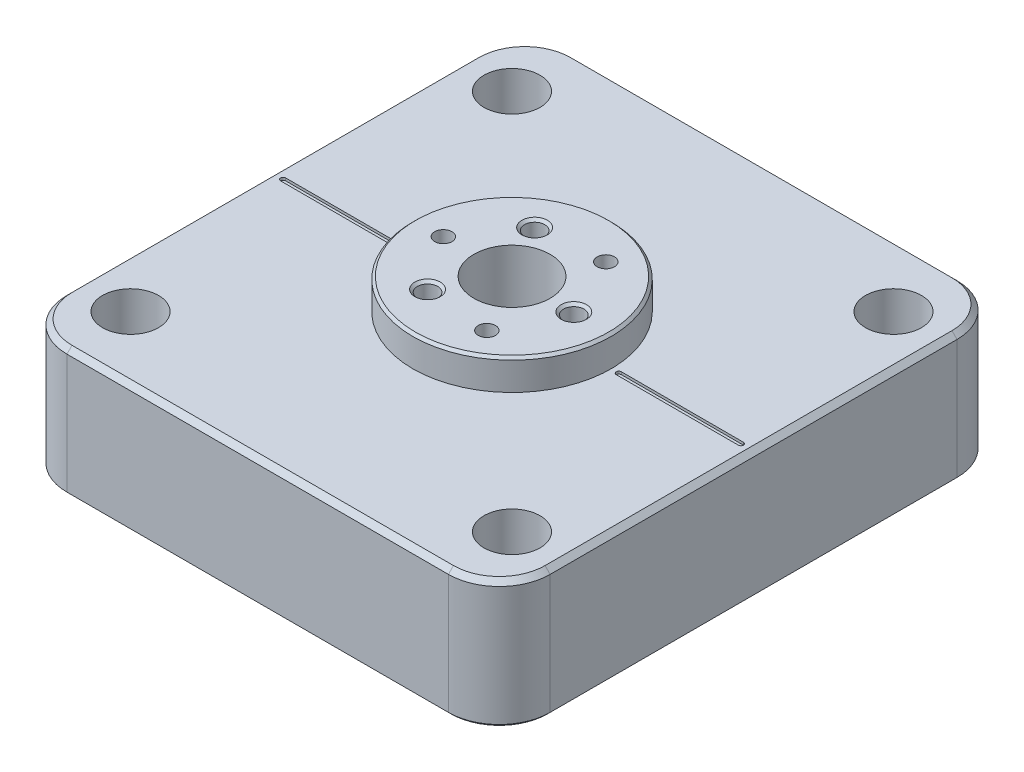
ISO-10303-21;
HEADER;
FILE_DESCRIPTION(('STEP AP214'),'2;1');
FILE_NAME('part.step','',(''),(''),'','','');
FILE_SCHEMA(('AUTOMOTIVE_DESIGN { 1 0 10303 214 1 1 1 1 }'));
ENDSEC;
DATA;
#1=APPLICATION_CONTEXT('core data for automotive mechanical design processes');
#2=APPLICATION_PROTOCOL_DEFINITION('international standard','automotive_design',2000,#1);
#3=PRODUCT_CONTEXT('',#1,'mechanical');
#4=PRODUCT('Part','Part','',(#3));
#5=PRODUCT_RELATED_PRODUCT_CATEGORY('part','',(#4));
#6=PRODUCT_DEFINITION_FORMATION('','',#4);
#7=PRODUCT_DEFINITION_CONTEXT('part definition',#1,'design');
#8=PRODUCT_DEFINITION('design','',#6,#7);
#9=PRODUCT_DEFINITION_SHAPE('','',#8);
#10=(LENGTH_UNIT() NAMED_UNIT(*) SI_UNIT(.MILLI.,.METRE.));
#11=(NAMED_UNIT(*) PLANE_ANGLE_UNIT() SI_UNIT($,.RADIAN.));
#12=(NAMED_UNIT(*) SI_UNIT($,.STERADIAN.) SOLID_ANGLE_UNIT());
#13=UNCERTAINTY_MEASURE_WITH_UNIT(LENGTH_MEASURE(1.E-05),#10,'distance_accuracy_value','');
#14=(GEOMETRIC_REPRESENTATION_CONTEXT(3) GLOBAL_UNCERTAINTY_ASSIGNED_CONTEXT((#13)) GLOBAL_UNIT_ASSIGNED_CONTEXT((#10,
#11,#12)) REPRESENTATION_CONTEXT('',''));
#15=CARTESIAN_POINT('',(0.,0.,0.));
#16=DIRECTION('',(0.,0.,1.));
#17=DIRECTION('',(1.,0.,0.));
#18=AXIS2_PLACEMENT_3D('',#15,#16,#17);
#19=CARTESIAN_POINT('',(0.,25.,0.));
#20=DIRECTION('',(0.,-1.,0.));
#21=DIRECTION('',(0.,0.,-1.));
#22=AXIS2_PLACEMENT_3D('',#19,#20,#21);
#23=PLANE('',#22);
#24=CARTESIAN_POINT('',(0.,25.,0.));
#25=DIRECTION('',(0.,1.,0.));
#26=DIRECTION('',(0.,0.,1.));
#27=AXIS2_PLACEMENT_3D('',#24,#25,#26);
#28=CIRCLE('',#27,19.5);
#29=CARTESIAN_POINT('',(0.,25.,19.5));
#30=VERTEX_POINT('',#29);
#31=EDGE_CURVE('E505',#30,#30,#28,.T.);
#32=ORIENTED_EDGE('',*,*,#31,.F.);
#33=EDGE_LOOP('',(#32));
#34=FACE_BOUND('',#33,.T.);
#35=CARTESIAN_POINT('',(-37.5,25.,-37.5));
#36=DIRECTION('',(0.,1.,0.));
#37=DIRECTION('',(0.,0.,1.));
#38=AXIS2_PLACEMENT_3D('',#35,#36,#37);
#39=CIRCLE('',#38,5.5);
#40=CARTESIAN_POINT('',(-37.5,25.,-32.));
#41=VERTEX_POINT('',#40);
#42=EDGE_CURVE('E492',#41,#41,#39,.T.);
#43=ORIENTED_EDGE('',*,*,#42,.F.);
#44=EDGE_LOOP('',(#43));
#45=FACE_BOUND('',#44,.T.);
#46=CARTESIAN_POINT('',(-37.5,25.,37.5));
#47=DIRECTION('',(0.,1.,0.));
#48=DIRECTION('',(0.,0.,1.));
#49=AXIS2_PLACEMENT_3D('',#46,#47,#48);
#50=CIRCLE('',#49,5.5);
#51=CARTESIAN_POINT('',(-37.5,25.,43.));
#52=VERTEX_POINT('',#51);
#53=EDGE_CURVE('E479',#52,#52,#50,.T.);
#54=ORIENTED_EDGE('',*,*,#53,.F.);
#55=EDGE_LOOP('',(#54));
#56=FACE_BOUND('',#55,.T.);
#57=CARTESIAN_POINT('',(37.5,25.,37.5));
#58=DIRECTION('',(0.,1.,0.));
#59=DIRECTION('',(0.,0.,1.));
#60=AXIS2_PLACEMENT_3D('',#57,#58,#59);
#61=CIRCLE('',#60,5.5);
#62=CARTESIAN_POINT('',(37.5,25.,43.));
#63=VERTEX_POINT('',#62);
#64=EDGE_CURVE('E466',#63,#63,#61,.T.);
#65=ORIENTED_EDGE('',*,*,#64,.F.);
#66=EDGE_LOOP('',(#65));
#67=FACE_BOUND('',#66,.T.);
#68=CARTESIAN_POINT('',(37.5,25.,-37.5));
#69=DIRECTION('',(0.,1.,0.));
#70=DIRECTION('',(0.,0.,1.));
#71=AXIS2_PLACEMENT_3D('',#68,#69,#70);
#72=CIRCLE('',#71,5.5);
#73=CARTESIAN_POINT('',(37.5,25.,-32.));
#74=VERTEX_POINT('',#73);
#75=EDGE_CURVE('E452',#74,#74,#72,.T.);
#76=ORIENTED_EDGE('',*,*,#75,.F.);
#77=EDGE_LOOP('',(#76));
#78=FACE_BOUND('',#77,.T.);
#79=DIRECTION('',(1.,0.,0.));
#80=VECTOR('',#79,1.);
#81=CARTESIAN_POINT('',(0.,25.,49.));
#82=LINE('',#81,#80);
#83=CARTESIAN_POINT('',(-37.5,25.,49.));
#84=VERTEX_POINT('',#83);
#85=CARTESIAN_POINT('',(37.5,25.,49.));
#86=VERTEX_POINT('',#85);
#87=EDGE_CURVE('E563',#84,#86,#82,.T.);
#88=ORIENTED_EDGE('',*,*,#87,.T.);
#89=CARTESIAN_POINT('',(37.5,25.,40.));
#90=DIRECTION('',(0.,-1.,0.));
#91=DIRECTION('',(0.,0.,-1.));
#92=AXIS2_PLACEMENT_3D('',#89,#90,#91);
#93=CIRCLE('',#92,9.00000000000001);
#94=CARTESIAN_POINT('',(46.5,25.,40.));
#95=VERTEX_POINT('',#94);
#96=EDGE_CURVE('E569',#86,#95,#93,.F.);
#97=ORIENTED_EDGE('',*,*,#96,.T.);
#98=DIRECTION('',(0.,0.,-1.));
#99=VECTOR('',#98,1.);
#100=CARTESIAN_POINT('',(46.5,25.,0.));
#101=LINE('',#100,#99);
#102=CARTESIAN_POINT('',(46.5,25.,-40.));
#103=VERTEX_POINT('',#102);
#104=EDGE_CURVE('E566',#95,#103,#101,.T.);
#105=ORIENTED_EDGE('',*,*,#104,.T.);
#106=CARTESIAN_POINT('',(37.5,25.,-40.));
#107=DIRECTION('',(0.,-1.,0.));
#108=DIRECTION('',(0.,0.,-1.));
#109=AXIS2_PLACEMENT_3D('',#106,#107,#108);
#110=CIRCLE('',#109,9.00000000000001);
#111=CARTESIAN_POINT('',(37.5,25.,-49.));
#112=VERTEX_POINT('',#111);
#113=EDGE_CURVE('E560',#103,#112,#110,.F.);
#114=ORIENTED_EDGE('',*,*,#113,.T.);
#115=DIRECTION('',(-1.,0.,0.));
#116=VECTOR('',#115,1.);
#117=CARTESIAN_POINT('',(0.,25.,-49.));
#118=LINE('',#117,#116);
#119=CARTESIAN_POINT('',(-37.5,25.,-49.));
#120=VERTEX_POINT('',#119);
#121=EDGE_CURVE('E554',#112,#120,#118,.T.);
#122=ORIENTED_EDGE('',*,*,#121,.T.);
#123=CARTESIAN_POINT('',(-37.5,25.,-40.));
#124=DIRECTION('',(0.,-1.,0.));
#125=DIRECTION('',(0.,0.,-1.));
#126=AXIS2_PLACEMENT_3D('',#123,#124,#125);
#127=CIRCLE('',#126,9.00000000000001);
#128=CARTESIAN_POINT('',(-46.5,25.,-40.));
#129=VERTEX_POINT('',#128);
#130=EDGE_CURVE('E509',#120,#129,#127,.F.);
#131=ORIENTED_EDGE('',*,*,#130,.T.);
#132=DIRECTION('',(0.,0.,1.));
#133=VECTOR('',#132,1.);
#134=CARTESIAN_POINT('',(-46.5,25.,0.));
#135=LINE('',#134,#133);
#136=CARTESIAN_POINT('',(-46.5,25.,40.));
#137=VERTEX_POINT('',#136);
#138=EDGE_CURVE('E551',#129,#137,#135,.T.);
#139=ORIENTED_EDGE('',*,*,#138,.T.);
#140=CARTESIAN_POINT('',(-37.5,25.,40.));
#141=DIRECTION('',(0.,-1.,0.));
#142=DIRECTION('',(0.,0.,-1.));
#143=AXIS2_PLACEMENT_3D('',#140,#141,#142);
#144=CIRCLE('',#143,9.00000000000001);
#145=EDGE_CURVE('E557',#137,#84,#144,.F.);
#146=ORIENTED_EDGE('',*,*,#145,.T.);
#147=EDGE_LOOP('',(#88,#97,#105,#114,#122,#131,#139,#146));
#148=FACE_BOUND('',#147,.T.);
#149=DIRECTION('',(1.,0.,0.));
#150=VECTOR('',#149,1.);
#151=CARTESIAN_POINT('',(-45.,25.,0.500000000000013));
#152=LINE('',#151,#150);
#153=CARTESIAN_POINT('',(-45.,25.,0.500000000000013));
#154=VERTEX_POINT('',#153);
#155=CARTESIAN_POINT('',(-21.,25.,0.500000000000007));
#156=VERTEX_POINT('',#155);
#157=EDGE_CURVE('E364',#154,#156,#152,.T.);
#158=ORIENTED_EDGE('',*,*,#157,.F.);
#159=CARTESIAN_POINT('',(-45.,25.,0.));
#160=DIRECTION('',(0.,1.,0.));
#161=DIRECTION('',(0.,0.,1.));
#162=AXIS2_PLACEMENT_3D('',#159,#160,#161);
#163=CIRCLE('',#162,0.500000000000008);
#164=CARTESIAN_POINT('',(-45.,25.,-0.500000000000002));
#165=VERTEX_POINT('',#164);
#166=EDGE_CURVE('E338',#165,#154,#163,.T.);
#167=ORIENTED_EDGE('',*,*,#166,.F.);
#168=DIRECTION('',(-1.,0.,0.));
#169=VECTOR('',#168,1.);
#170=CARTESIAN_POINT('',(-45.,25.,-0.500000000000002));
#171=LINE('',#170,#169);
#172=CARTESIAN_POINT('',(-21.,25.,-0.500000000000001));
#173=VERTEX_POINT('',#172);
#174=EDGE_CURVE('E349',#173,#165,#171,.T.);
#175=ORIENTED_EDGE('',*,*,#174,.F.);
#176=CARTESIAN_POINT('',(-21.,25.,0.));
#177=DIRECTION('',(0.,1.,0.));
#178=DIRECTION('',(0.,0.,1.));
#179=AXIS2_PLACEMENT_3D('',#176,#177,#178);
#180=CIRCLE('',#179,0.500000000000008);
#181=EDGE_CURVE('E368',#156,#173,#180,.T.);
#182=ORIENTED_EDGE('',*,*,#181,.F.);
#183=EDGE_LOOP('',(#158,#167,#175,#182));
#184=FACE_BOUND('',#183,.T.);
#185=CARTESIAN_POINT('',(45.,25.,0.));
#186=DIRECTION('',(0.,-1.,0.));
#187=DIRECTION('',(0.,0.,1.));
#188=AXIS2_PLACEMENT_3D('',#185,#186,#187);
#189=CIRCLE('',#188,0.500000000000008);
#190=CARTESIAN_POINT('',(45.,25.,-0.500000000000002));
#191=VERTEX_POINT('',#190);
#192=CARTESIAN_POINT('',(45.,25.,0.500000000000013));
#193=VERTEX_POINT('',#192);
#194=EDGE_CURVE('E304',#191,#193,#189,.T.);
#195=ORIENTED_EDGE('',*,*,#194,.T.);
#196=DIRECTION('',(-1.,0.,0.));
#197=VECTOR('',#196,1.);
#198=CARTESIAN_POINT('',(45.,25.,0.500000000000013));
#199=LINE('',#198,#197);
#200=CARTESIAN_POINT('',(21.,25.,0.500000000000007));
#201=VERTEX_POINT('',#200);
#202=EDGE_CURVE('E310',#193,#201,#199,.T.);
#203=ORIENTED_EDGE('',*,*,#202,.T.);
#204=CARTESIAN_POINT('',(21.,25.,0.));
#205=DIRECTION('',(0.,-1.,0.));
#206=DIRECTION('',(0.,0.,1.));
#207=AXIS2_PLACEMENT_3D('',#204,#205,#206);
#208=CIRCLE('',#207,0.500000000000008);
#209=CARTESIAN_POINT('',(21.,25.,-0.500000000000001));
#210=VERTEX_POINT('',#209);
#211=EDGE_CURVE('E316',#201,#210,#208,.T.);
#212=ORIENTED_EDGE('',*,*,#211,.T.);
#213=DIRECTION('',(1.,0.,0.));
#214=VECTOR('',#213,1.);
#215=CARTESIAN_POINT('',(45.,25.,-0.500000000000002));
#216=LINE('',#215,#214);
#217=EDGE_CURVE('E328',#210,#191,#216,.T.);
#218=ORIENTED_EDGE('',*,*,#217,.T.);
#219=EDGE_LOOP('',(#195,#203,#212,#218));
#220=FACE_BOUND('',#219,.T.);
#221=ADVANCED_FACE('F46',(#34,#45,#56,#67,#78,#148,#184,#220),#23,.F.);
#222=CARTESIAN_POINT('',(47.5,25.,50.));
#223=DIRECTION('',(-1.,0.,0.));
#224=DIRECTION('',(0.,0.,1.));
#225=AXIS2_PLACEMENT_3D('',#222,#223,#224);
#226=PLANE('',#225);
#227=DIRECTION('',(0.,-1.,0.));
#228=VECTOR('',#227,1.);
#229=CARTESIAN_POINT('',(47.5,25.,40.));
#230=LINE('',#229,#228);
#231=CARTESIAN_POINT('',(47.5,24.,40.));
#232=VERTEX_POINT('',#231);
#233=CARTESIAN_POINT('',(47.5,0.5,40.));
#234=VERTEX_POINT('',#233);
#235=EDGE_CURVE('E514',#232,#234,#230,.T.);
#236=ORIENTED_EDGE('',*,*,#235,.T.);
#237=DIRECTION('',(0.,0.,-1.));
#238=VECTOR('',#237,1.);
#239=CARTESIAN_POINT('',(47.5,0.5,-40.));
#240=LINE('',#239,#238);
#241=CARTESIAN_POINT('',(47.5,0.5,-40.));
#242=VERTEX_POINT('',#241);
#243=EDGE_CURVE('E720',#234,#242,#240,.T.);
#244=ORIENTED_EDGE('',*,*,#243,.T.);
#245=DIRECTION('',(0.,-1.,0.));
#246=VECTOR('',#245,1.);
#247=CARTESIAN_POINT('',(47.5,25.,-40.));
#248=LINE('',#247,#246);
#249=CARTESIAN_POINT('',(47.5,24.,-40.));
#250=VERTEX_POINT('',#249);
#251=EDGE_CURVE('E511',#242,#250,#248,.F.);
#252=ORIENTED_EDGE('',*,*,#251,.T.);
#253=DIRECTION('',(0.,0.,1.));
#254=VECTOR('',#253,1.);
#255=CARTESIAN_POINT('',(47.5,24.,50.));
#256=LINE('',#255,#254);
#257=EDGE_CURVE('E577',#250,#232,#256,.T.);
#258=ORIENTED_EDGE('',*,*,#257,.T.);
#259=EDGE_LOOP('',(#236,#244,#252,#258));
#260=FACE_BOUND('',#259,.T.);
#261=ADVANCED_FACE('F871',(#260),#226,.F.);
#262=CARTESIAN_POINT('',(-47.5,25.,-50.));
#263=DIRECTION('',(0.,0.,1.));
#264=DIRECTION('',(1.,0.,0.));
#265=AXIS2_PLACEMENT_3D('',#262,#263,#264);
#266=PLANE('',#265);
#267=DIRECTION('',(0.,-1.,0.));
#268=VECTOR('',#267,1.);
#269=CARTESIAN_POINT('',(37.5,25.,-50.));
#270=LINE('',#269,#268);
#271=CARTESIAN_POINT('',(37.5,24.,-50.));
#272=VERTEX_POINT('',#271);
#273=CARTESIAN_POINT('',(37.5,0.5,-50.));
#274=VERTEX_POINT('',#273);
#275=EDGE_CURVE('E531',#272,#274,#270,.T.);
#276=ORIENTED_EDGE('',*,*,#275,.T.);
#277=DIRECTION('',(-1.,0.,0.));
#278=VECTOR('',#277,1.);
#279=CARTESIAN_POINT('',(-37.5,0.5,-50.));
#280=LINE('',#279,#278);
#281=CARTESIAN_POINT('',(-37.5,0.5,-50.));
#282=VERTEX_POINT('',#281);
#283=EDGE_CURVE('E786',#274,#282,#280,.T.);
#284=ORIENTED_EDGE('',*,*,#283,.T.);
#285=DIRECTION('',(0.,-1.,0.));
#286=VECTOR('',#285,1.);
#287=CARTESIAN_POINT('',(-37.5,25.,-50.));
#288=LINE('',#287,#286);
#289=CARTESIAN_POINT('',(-37.5,24.,-50.));
#290=VERTEX_POINT('',#289);
#291=EDGE_CURVE('E510',#282,#290,#288,.F.);
#292=ORIENTED_EDGE('',*,*,#291,.T.);
#293=DIRECTION('',(1.,0.,0.));
#294=VECTOR('',#293,1.);
#295=CARTESIAN_POINT('',(-47.5,24.,-50.));
#296=LINE('',#295,#294);
#297=EDGE_CURVE('E591',#290,#272,#296,.T.);
#298=ORIENTED_EDGE('',*,*,#297,.T.);
#299=EDGE_LOOP('',(#276,#284,#292,#298));
#300=FACE_BOUND('',#299,.T.);
#301=ADVANCED_FACE('F877',(#300),#266,.F.);
#302=CARTESIAN_POINT('',(-47.5,25.,50.));
#303=DIRECTION('',(1.,0.,0.));
#304=DIRECTION('',(0.,0.,-1.));
#305=AXIS2_PLACEMENT_3D('',#302,#303,#304);
#306=PLANE('',#305);
#307=DIRECTION('',(0.,-1.,0.));
#308=VECTOR('',#307,1.);
#309=CARTESIAN_POINT('',(-47.5,25.,-40.));
#310=LINE('',#309,#308);
#311=CARTESIAN_POINT('',(-47.5,24.,-40.));
#312=VERTEX_POINT('',#311);
#313=CARTESIAN_POINT('',(-47.5,0.5,-40.));
#314=VERTEX_POINT('',#313);
#315=EDGE_CURVE('E528',#312,#314,#310,.T.);
#316=ORIENTED_EDGE('',*,*,#315,.T.);
#317=DIRECTION('',(0.,0.,1.));
#318=VECTOR('',#317,1.);
#319=CARTESIAN_POINT('',(-47.5,0.5,40.));
#320=LINE('',#319,#318);
#321=CARTESIAN_POINT('',(-47.5,0.5,40.));
#322=VERTEX_POINT('',#321);
#323=EDGE_CURVE('E63',#314,#322,#320,.T.);
#324=ORIENTED_EDGE('',*,*,#323,.T.);
#325=DIRECTION('',(0.,-1.,0.));
#326=VECTOR('',#325,1.);
#327=CARTESIAN_POINT('',(-47.5,25.,40.));
#328=LINE('',#327,#326);
#329=CARTESIAN_POINT('',(-47.5,24.,40.));
#330=VERTEX_POINT('',#329);
#331=EDGE_CURVE('E525',#322,#330,#328,.F.);
#332=ORIENTED_EDGE('',*,*,#331,.T.);
#333=DIRECTION('',(0.,0.,-1.));
#334=VECTOR('',#333,1.);
#335=CARTESIAN_POINT('',(-47.5,24.,50.));
#336=LINE('',#335,#334);
#337=EDGE_CURVE('E594',#330,#312,#336,.T.);
#338=ORIENTED_EDGE('',*,*,#337,.T.);
#339=EDGE_LOOP('',(#316,#324,#332,#338));
#340=FACE_BOUND('',#339,.T.);
#341=ADVANCED_FACE('F894',(#340),#306,.F.);
#342=CARTESIAN_POINT('',(-47.5,25.,50.));
#343=DIRECTION('',(0.,0.,-1.));
#344=DIRECTION('',(-1.,0.,0.));
#345=AXIS2_PLACEMENT_3D('',#342,#343,#344);
#346=PLANE('',#345);
#347=DIRECTION('',(0.,-1.,0.));
#348=VECTOR('',#347,1.);
#349=CARTESIAN_POINT('',(-37.5,25.,50.));
#350=LINE('',#349,#348);
#351=CARTESIAN_POINT('',(-37.5,24.,50.));
#352=VERTEX_POINT('',#351);
#353=CARTESIAN_POINT('',(-37.5,0.5,50.));
#354=VERTEX_POINT('',#353);
#355=EDGE_CURVE('E518',#352,#354,#350,.T.);
#356=ORIENTED_EDGE('',*,*,#355,.T.);
#357=DIRECTION('',(1.,0.,0.));
#358=VECTOR('',#357,1.);
#359=CARTESIAN_POINT('',(37.5,0.5,50.));
#360=LINE('',#359,#358);
#361=CARTESIAN_POINT('',(37.5,0.5,50.));
#362=VERTEX_POINT('',#361);
#363=EDGE_CURVE('E789',#354,#362,#360,.T.);
#364=ORIENTED_EDGE('',*,*,#363,.T.);
#365=DIRECTION('',(0.,-1.,0.));
#366=VECTOR('',#365,1.);
#367=CARTESIAN_POINT('',(37.5,25.,50.));
#368=LINE('',#367,#366);
#369=CARTESIAN_POINT('',(37.5,24.,50.));
#370=VERTEX_POINT('',#369);
#371=EDGE_CURVE('E522',#362,#370,#368,.F.);
#372=ORIENTED_EDGE('',*,*,#371,.T.);
#373=DIRECTION('',(-1.,0.,0.));
#374=VECTOR('',#373,1.);
#375=CARTESIAN_POINT('',(-47.5,24.,50.));
#376=LINE('',#375,#374);
#377=EDGE_CURVE('E580',#370,#352,#376,.T.);
#378=ORIENTED_EDGE('',*,*,#377,.T.);
#379=EDGE_LOOP('',(#356,#364,#372,#378));
#380=FACE_BOUND('',#379,.T.);
#381=ADVANCED_FACE('F890',(#380),#346,.F.);
#382=CARTESIAN_POINT('',(0.,0.,0.));
#383=DIRECTION('',(0.,-1.,0.));
#384=DIRECTION('',(0.,0.,-1.));
#385=AXIS2_PLACEMENT_3D('',#382,#383,#384);
#386=PLANE('',#385);
#387=CARTESIAN_POINT('',(37.5,0.,-40.));
#388=DIRECTION('',(0.,-1.,0.));
#389=DIRECTION('',(0.,0.,-1.));
#390=AXIS2_PLACEMENT_3D('',#387,#388,#389);
#391=CIRCLE('',#390,9.5);
#392=CARTESIAN_POINT('',(37.5,0.,-49.5));
#393=VERTEX_POINT('',#392);
#394=CARTESIAN_POINT('',(47.,0.,-40.));
#395=VERTEX_POINT('',#394);
#396=EDGE_CURVE('E773',#393,#395,#391,.T.);
#397=ORIENTED_EDGE('',*,*,#396,.T.);
#398=DIRECTION('',(0.,0.,1.));
#399=VECTOR('',#398,1.);
#400=CARTESIAN_POINT('',(47.,0.,40.));
#401=LINE('',#400,#399);
#402=CARTESIAN_POINT('',(47.,0.,40.));
#403=VERTEX_POINT('',#402);
#404=EDGE_CURVE('E776',#395,#403,#401,.T.);
#405=ORIENTED_EDGE('',*,*,#404,.T.);
#406=CARTESIAN_POINT('',(37.5,0.,40.));
#407=DIRECTION('',(0.,-1.,0.));
#408=DIRECTION('',(0.,0.,-1.));
#409=AXIS2_PLACEMENT_3D('',#406,#407,#408);
#410=CIRCLE('',#409,9.5);
#411=CARTESIAN_POINT('',(37.5,0.,49.5));
#412=VERTEX_POINT('',#411);
#413=EDGE_CURVE('E770',#403,#412,#410,.T.);
#414=ORIENTED_EDGE('',*,*,#413,.T.);
#415=DIRECTION('',(-1.,0.,0.));
#416=VECTOR('',#415,1.);
#417=CARTESIAN_POINT('',(-37.5,0.,49.5));
#418=LINE('',#417,#416);
#419=CARTESIAN_POINT('',(-37.5,0.,49.5));
#420=VERTEX_POINT('',#419);
#421=EDGE_CURVE('E764',#412,#420,#418,.T.);
#422=ORIENTED_EDGE('',*,*,#421,.T.);
#423=CARTESIAN_POINT('',(-37.5,0.,40.));
#424=DIRECTION('',(0.,-1.,0.));
#425=DIRECTION('',(0.,0.,-1.));
#426=AXIS2_PLACEMENT_3D('',#423,#424,#425);
#427=CIRCLE('',#426,9.5);
#428=CARTESIAN_POINT('',(-47.,0.,40.));
#429=VERTEX_POINT('',#428);
#430=EDGE_CURVE('E758',#420,#429,#427,.T.);
#431=ORIENTED_EDGE('',*,*,#430,.T.);
#432=DIRECTION('',(0.,0.,-1.));
#433=VECTOR('',#432,1.);
#434=CARTESIAN_POINT('',(-47.,0.,-40.));
#435=LINE('',#434,#433);
#436=CARTESIAN_POINT('',(-47.,0.,-40.));
#437=VERTEX_POINT('',#436);
#438=EDGE_CURVE('E755',#429,#437,#435,.T.);
#439=ORIENTED_EDGE('',*,*,#438,.T.);
#440=CARTESIAN_POINT('',(-37.5,0.,-40.));
#441=DIRECTION('',(0.,-1.,0.));
#442=DIRECTION('',(0.,0.,-1.));
#443=AXIS2_PLACEMENT_3D('',#440,#441,#442);
#444=CIRCLE('',#443,9.5);
#445=CARTESIAN_POINT('',(-37.5,0.,-49.5));
#446=VERTEX_POINT('',#445);
#447=EDGE_CURVE('E761',#437,#446,#444,.T.);
#448=ORIENTED_EDGE('',*,*,#447,.T.);
#449=DIRECTION('',(1.,0.,0.));
#450=VECTOR('',#449,1.);
#451=CARTESIAN_POINT('',(37.5,0.,-49.5));
#452=LINE('',#451,#450);
#453=EDGE_CURVE('E767',#446,#393,#452,.T.);
#454=ORIENTED_EDGE('',*,*,#453,.T.);
#455=EDGE_LOOP('',(#397,#405,#414,#422,#431,#439,#448,#454));
#456=FACE_BOUND('',#455,.T.);
#457=CARTESIAN_POINT('',(22.5,0.,-25.));
#458=DIRECTION('',(0.,-1.,0.));
#459=DIRECTION('',(0.,0.,-1.));
#460=AXIS2_PLACEMENT_3D('',#457,#458,#459);
#461=CIRCLE('',#460,10.5);
#462=CARTESIAN_POINT('',(33.,0.,-25.));
#463=VERTEX_POINT('',#462);
#464=CARTESIAN_POINT('',(22.5,0.,-35.5));
#465=VERTEX_POINT('',#464);
#466=EDGE_CURVE('E692',#463,#465,#461,.F.);
#467=ORIENTED_EDGE('',*,*,#466,.T.);
#468=DIRECTION('',(-1.,0.,0.));
#469=VECTOR('',#468,1.);
#470=CARTESIAN_POINT('',(-22.5,0.,-35.5));
#471=LINE('',#470,#469);
#472=CARTESIAN_POINT('',(-22.5,0.,-35.5));
#473=VERTEX_POINT('',#472);
#474=EDGE_CURVE('E695',#465,#473,#471,.T.);
#475=ORIENTED_EDGE('',*,*,#474,.T.);
#476=CARTESIAN_POINT('',(-22.5,0.,-25.));
#477=DIRECTION('',(0.,-1.,0.));
#478=DIRECTION('',(0.,0.,-1.));
#479=AXIS2_PLACEMENT_3D('',#476,#477,#478);
#480=CIRCLE('',#479,10.5);
#481=CARTESIAN_POINT('',(-33.,0.,-25.));
#482=VERTEX_POINT('',#481);
#483=EDGE_CURVE('E689',#473,#482,#480,.F.);
#484=ORIENTED_EDGE('',*,*,#483,.T.);
#485=DIRECTION('',(0.,0.,1.));
#486=VECTOR('',#485,1.);
#487=CARTESIAN_POINT('',(-33.,0.,25.));
#488=LINE('',#487,#486);
#489=CARTESIAN_POINT('',(-33.,0.,25.));
#490=VERTEX_POINT('',#489);
#491=EDGE_CURVE('E683',#482,#490,#488,.T.);
#492=ORIENTED_EDGE('',*,*,#491,.T.);
#493=CARTESIAN_POINT('',(-22.5,0.,25.));
#494=DIRECTION('',(0.,-1.,0.));
#495=DIRECTION('',(0.,0.,-1.));
#496=AXIS2_PLACEMENT_3D('',#493,#494,#495);
#497=CIRCLE('',#496,10.5);
#498=CARTESIAN_POINT('',(-22.5,0.,35.5));
#499=VERTEX_POINT('',#498);
#500=EDGE_CURVE('E677',#490,#499,#497,.F.);
#501=ORIENTED_EDGE('',*,*,#500,.T.);
#502=DIRECTION('',(1.,0.,0.));
#503=VECTOR('',#502,1.);
#504=CARTESIAN_POINT('',(22.5,0.,35.5));
#505=LINE('',#504,#503);
#506=CARTESIAN_POINT('',(22.5,0.,35.5));
#507=VERTEX_POINT('',#506);
#508=EDGE_CURVE('E674',#499,#507,#505,.T.);
#509=ORIENTED_EDGE('',*,*,#508,.T.);
#510=CARTESIAN_POINT('',(22.5,0.,25.));
#511=DIRECTION('',(0.,-1.,0.));
#512=DIRECTION('',(0.,0.,-1.));
#513=AXIS2_PLACEMENT_3D('',#510,#511,#512);
#514=CIRCLE('',#513,10.5);
#515=CARTESIAN_POINT('',(33.,0.,25.));
#516=VERTEX_POINT('',#515);
#517=EDGE_CURVE('E680',#507,#516,#514,.F.);
#518=ORIENTED_EDGE('',*,*,#517,.T.);
#519=DIRECTION('',(0.,0.,-1.));
#520=VECTOR('',#519,1.);
#521=CARTESIAN_POINT('',(33.,0.,-25.));
#522=LINE('',#521,#520);
#523=EDGE_CURVE('E686',#516,#463,#522,.T.);
#524=ORIENTED_EDGE('',*,*,#523,.T.);
#525=EDGE_LOOP('',(#467,#475,#484,#492,#501,#509,#518,#524));
#526=FACE_BOUND('',#525,.T.);
#527=CARTESIAN_POINT('',(37.5,0.,-37.5));
#528=DIRECTION('',(0.,-1.,0.));
#529=DIRECTION('',(0.,0.,-1.));
#530=AXIS2_PLACEMENT_3D('',#527,#528,#529);
#531=CIRCLE('',#530,3.29999999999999);
#532=CARTESIAN_POINT('',(37.5,0.,-40.8));
#533=VERTEX_POINT('',#532);
#534=EDGE_CURVE('E465',#533,#533,#531,.T.);
#535=ORIENTED_EDGE('',*,*,#534,.F.);
#536=EDGE_LOOP('',(#535));
#537=FACE_BOUND('',#536,.T.);
#538=CARTESIAN_POINT('',(37.5,0.,37.5));
#539=DIRECTION('',(0.,-1.,0.));
#540=DIRECTION('',(0.,0.,-1.));
#541=AXIS2_PLACEMENT_3D('',#538,#539,#540);
#542=CIRCLE('',#541,3.29999999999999);
#543=CARTESIAN_POINT('',(37.5,0.,34.2));
#544=VERTEX_POINT('',#543);
#545=EDGE_CURVE('E478',#544,#544,#542,.T.);
#546=ORIENTED_EDGE('',*,*,#545,.F.);
#547=EDGE_LOOP('',(#546));
#548=FACE_BOUND('',#547,.T.);
#549=CARTESIAN_POINT('',(-37.5,0.,37.5));
#550=DIRECTION('',(0.,-1.,0.));
#551=DIRECTION('',(0.,0.,-1.));
#552=AXIS2_PLACEMENT_3D('',#549,#550,#551);
#553=CIRCLE('',#552,3.29999999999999);
#554=CARTESIAN_POINT('',(-37.5,0.,34.2));
#555=VERTEX_POINT('',#554);
#556=EDGE_CURVE('E491',#555,#555,#553,.T.);
#557=ORIENTED_EDGE('',*,*,#556,.F.);
#558=EDGE_LOOP('',(#557));
#559=FACE_BOUND('',#558,.T.);
#560=CARTESIAN_POINT('',(-37.5,0.,-37.5));
#561=DIRECTION('',(0.,-1.,0.));
#562=DIRECTION('',(0.,0.,-1.));
#563=AXIS2_PLACEMENT_3D('',#560,#561,#562);
#564=CIRCLE('',#563,3.29999999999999);
#565=CARTESIAN_POINT('',(-37.5,0.,-40.8));
#566=VERTEX_POINT('',#565);
#567=EDGE_CURVE('E504',#566,#566,#564,.T.);
#568=ORIENTED_EDGE('',*,*,#567,.F.);
#569=EDGE_LOOP('',(#568));
#570=FACE_BOUND('',#569,.T.);
#571=ADVANCED_FACE('F886',(#456,#526,#537,#548,#559,#570),#386,.T.);
#572=CARTESIAN_POINT('',(37.5,25.,40.));
#573=DIRECTION('',(0.,-1.,0.));
#574=DIRECTION('',(0.,0.,-1.));
#575=AXIS2_PLACEMENT_3D('',#572,#573,#574);
#576=CYLINDRICAL_SURFACE('',#575,10.);
#577=ORIENTED_EDGE('',*,*,#371,.F.);
#578=CARTESIAN_POINT('',(37.5,0.5,40.));
#579=DIRECTION('',(0.,-1.,0.));
#580=DIRECTION('',(0.,0.,-1.));
#581=AXIS2_PLACEMENT_3D('',#578,#579,#580);
#582=CIRCLE('',#581,10.);
#583=EDGE_CURVE('E783',#362,#234,#582,.F.);
#584=ORIENTED_EDGE('',*,*,#583,.T.);
#585=ORIENTED_EDGE('',*,*,#235,.F.);
#586=CARTESIAN_POINT('',(37.5,24.,40.));
#587=DIRECTION('',(0.,-1.,0.));
#588=DIRECTION('',(0.,0.,-1.));
#589=AXIS2_PLACEMENT_3D('',#586,#587,#588);
#590=CIRCLE('',#589,10.);
#591=EDGE_CURVE('E573',#232,#370,#590,.T.);
#592=ORIENTED_EDGE('',*,*,#591,.T.);
#593=EDGE_LOOP('',(#577,#584,#585,#592));
#594=FACE_BOUND('',#593,.T.);
#595=ADVANCED_FACE('F889',(#594),#576,.T.);
#596=CARTESIAN_POINT('',(-37.5,25.,-40.));
#597=DIRECTION('',(0.,-1.,0.));
#598=DIRECTION('',(0.,0.,-1.));
#599=AXIS2_PLACEMENT_3D('',#596,#597,#598);
#600=CYLINDRICAL_SURFACE('',#599,10.);
#601=ORIENTED_EDGE('',*,*,#291,.F.);
#602=CARTESIAN_POINT('',(-37.5,0.5,-40.));
#603=DIRECTION('',(0.,-1.,0.));
#604=DIRECTION('',(0.,0.,-1.));
#605=AXIS2_PLACEMENT_3D('',#602,#603,#604);
#606=CIRCLE('',#605,10.);
#607=EDGE_CURVE('E71',#282,#314,#606,.F.);
#608=ORIENTED_EDGE('',*,*,#607,.T.);
#609=ORIENTED_EDGE('',*,*,#315,.F.);
#610=CARTESIAN_POINT('',(-37.5,24.,-40.));
#611=DIRECTION('',(0.,-1.,0.));
#612=DIRECTION('',(0.,0.,-1.));
#613=AXIS2_PLACEMENT_3D('',#610,#611,#612);
#614=CIRCLE('',#613,10.);
#615=EDGE_CURVE('E597',#312,#290,#614,.T.);
#616=ORIENTED_EDGE('',*,*,#615,.T.);
#617=EDGE_LOOP('',(#601,#608,#609,#616));
#618=FACE_BOUND('',#617,.T.);
#619=ADVANCED_FACE('F903',(#618),#600,.T.);
#620=CARTESIAN_POINT('',(37.5,25.,-40.));
#621=DIRECTION('',(0.,-1.,0.));
#622=DIRECTION('',(0.,0.,-1.));
#623=AXIS2_PLACEMENT_3D('',#620,#621,#622);
#624=CYLINDRICAL_SURFACE('',#623,10.);
#625=ORIENTED_EDGE('',*,*,#251,.F.);
#626=CARTESIAN_POINT('',(37.5,0.5,-40.));
#627=DIRECTION('',(0.,-1.,0.));
#628=DIRECTION('',(0.,0.,-1.));
#629=AXIS2_PLACEMENT_3D('',#626,#627,#628);
#630=CIRCLE('',#629,10.);
#631=EDGE_CURVE('E780',#242,#274,#630,.F.);
#632=ORIENTED_EDGE('',*,*,#631,.T.);
#633=ORIENTED_EDGE('',*,*,#275,.F.);
#634=CARTESIAN_POINT('',(37.5,24.,-40.));
#635=DIRECTION('',(0.,-1.,0.));
#636=DIRECTION('',(0.,0.,-1.));
#637=AXIS2_PLACEMENT_3D('',#634,#635,#636);
#638=CIRCLE('',#637,10.);
#639=EDGE_CURVE('E583',#272,#250,#638,.T.);
#640=ORIENTED_EDGE('',*,*,#639,.T.);
#641=EDGE_LOOP('',(#625,#632,#633,#640));
#642=FACE_BOUND('',#641,.T.);
#643=ADVANCED_FACE('F907',(#642),#624,.T.);
#644=CARTESIAN_POINT('',(-37.5,25.,40.));
#645=DIRECTION('',(0.,-1.,0.));
#646=DIRECTION('',(0.,0.,-1.));
#647=AXIS2_PLACEMENT_3D('',#644,#645,#646);
#648=CYLINDRICAL_SURFACE('',#647,10.);
#649=ORIENTED_EDGE('',*,*,#331,.F.);
#650=CARTESIAN_POINT('',(-37.5,0.5,40.));
#651=DIRECTION('',(0.,-1.,0.));
#652=DIRECTION('',(0.,0.,-1.));
#653=AXIS2_PLACEMENT_3D('',#650,#651,#652);
#654=CIRCLE('',#653,10.);
#655=EDGE_CURVE('E794',#322,#354,#654,.F.);
#656=ORIENTED_EDGE('',*,*,#655,.T.);
#657=ORIENTED_EDGE('',*,*,#355,.F.);
#658=CARTESIAN_POINT('',(-37.5,24.,40.));
#659=DIRECTION('',(0.,-1.,0.));
#660=DIRECTION('',(0.,0.,-1.));
#661=AXIS2_PLACEMENT_3D('',#658,#659,#660);
#662=CIRCLE('',#661,10.);
#663=EDGE_CURVE('E587',#352,#330,#662,.T.);
#664=ORIENTED_EDGE('',*,*,#663,.T.);
#665=EDGE_LOOP('',(#649,#656,#657,#664));
#666=FACE_BOUND('',#665,.T.);
#667=ADVANCED_FACE('F910',(#666),#648,.T.);
#668=CARTESIAN_POINT('',(0.,31.,0.));
#669=DIRECTION('',(0.,-1.,0.));
#670=DIRECTION('',(0.,0.,-1.));
#671=AXIS2_PLACEMENT_3D('',#668,#669,#670);
#672=CYLINDRICAL_SURFACE('',#671,19.5);
#673=CARTESIAN_POINT('',(0.,30.5,0.));
#674=DIRECTION('',(0.,1.,0.));
#675=DIRECTION('',(0.,0.,1.));
#676=AXIS2_PLACEMENT_3D('',#673,#674,#675);
#677=CIRCLE('',#676,19.5);
#678=CARTESIAN_POINT('',(0.,30.5,19.5));
#679=VERTEX_POINT('',#678);
#680=EDGE_CURVE('E11',#679,#679,#677,.F.);
#681=ORIENTED_EDGE('',*,*,#680,.T.);
#682=EDGE_LOOP('',(#681));
#683=FACE_BOUND('',#682,.T.);
#684=ORIENTED_EDGE('',*,*,#31,.T.);
#685=EDGE_LOOP('',(#684));
#686=FACE_BOUND('',#685,.T.);
#687=ADVANCED_FACE('F884',(#683,#686),#672,.T.);
#688=CARTESIAN_POINT('',(0.,31.,0.));
#689=DIRECTION('',(0.,1.,0.));
#690=DIRECTION('',(0.,0.,1.));
#691=AXIS2_PLACEMENT_3D('',#688,#689,#690);
#692=PLANE('',#691);
#693=CARTESIAN_POINT('',(0.,31.,0.));
#694=DIRECTION('',(0.,1.,0.));
#695=DIRECTION('',(0.,0.,1.));
#696=AXIS2_PLACEMENT_3D('',#693,#694,#695);
#697=CIRCLE('',#696,19.);
#698=CARTESIAN_POINT('',(0.,31.,19.));
#699=VERTEX_POINT('',#698);
#700=EDGE_CURVE('E56',#699,#699,#697,.T.);
#701=ORIENTED_EDGE('',*,*,#700,.T.);
#702=EDGE_LOOP('',(#701));
#703=FACE_BOUND('',#702,.T.);
#704=CARTESIAN_POINT('',(-6.07500000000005,31.,10.5222086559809));
#705=DIRECTION('',(0.,1.,0.));
#706=DIRECTION('',(0.,0.,1.));
#707=AXIS2_PLACEMENT_3D('',#704,#705,#706);
#708=CIRCLE('',#707,2.50000000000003);
#709=CARTESIAN_POINT('',(-6.07500000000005,31.,13.0222086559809));
#710=VERTEX_POINT('',#709);
#711=EDGE_CURVE('E841',#710,#710,#708,.F.);
#712=ORIENTED_EDGE('',*,*,#711,.T.);
#713=EDGE_LOOP('',(#712));
#714=FACE_BOUND('',#713,.T.);
#715=CARTESIAN_POINT('',(12.15,31.,0.));
#716=DIRECTION('',(0.,1.,0.));
#717=DIRECTION('',(0.,0.,1.));
#718=AXIS2_PLACEMENT_3D('',#715,#716,#717);
#719=CIRCLE('',#718,2.50000000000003);
#720=CARTESIAN_POINT('',(12.15,31.,2.50000000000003));
#721=VERTEX_POINT('',#720);
#722=EDGE_CURVE('E837',#721,#721,#719,.F.);
#723=ORIENTED_EDGE('',*,*,#722,.T.);
#724=EDGE_LOOP('',(#723));
#725=FACE_BOUND('',#724,.T.);
#726=CARTESIAN_POINT('',(-6.0749999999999,31.,-10.522208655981));
#727=DIRECTION('',(0.,1.,0.));
#728=DIRECTION('',(0.,0.,1.));
#729=AXIS2_PLACEMENT_3D('',#726,#727,#728);
#730=CIRCLE('',#729,2.50000000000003);
#731=CARTESIAN_POINT('',(-6.0749999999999,31.,-8.02220865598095));
#732=VERTEX_POINT('',#731);
#733=EDGE_CURVE('E833',#732,#732,#730,.F.);
#734=ORIENTED_EDGE('',*,*,#733,.T.);
#735=EDGE_LOOP('',(#734));
#736=FACE_BOUND('',#735,.T.);
#737=CARTESIAN_POINT('',(0.,31.,0.));
#738=DIRECTION('',(0.,-1.,0.));
#739=DIRECTION('',(0.,0.,-1.));
#740=AXIS2_PLACEMENT_3D('',#737,#738,#739);
#741=CIRCLE('',#740,7.5);
#742=CARTESIAN_POINT('',(0.,31.,-7.5));
#743=VERTEX_POINT('',#742);
#744=EDGE_CURVE('E329',#743,#743,#741,.T.);
#745=ORIENTED_EDGE('',*,*,#744,.T.);
#746=EDGE_LOOP('',(#745));
#747=FACE_BOUND('',#746,.T.);
#748=CARTESIAN_POINT('',(6.74999999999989,31.,11.69134295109));
#749=DIRECTION('',(0.,-1.,0.));
#750=DIRECTION('',(0.,0.,-1.));
#751=AXIS2_PLACEMENT_3D('',#748,#749,#750);
#752=CIRCLE('',#751,1.7);
#753=CARTESIAN_POINT('',(6.74999999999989,31.,9.99134295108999));
#754=VERTEX_POINT('',#753);
#755=EDGE_CURVE('E399',#754,#754,#752,.T.);
#756=ORIENTED_EDGE('',*,*,#755,.T.);
#757=EDGE_LOOP('',(#756));
#758=FACE_BOUND('',#757,.T.);
#759=CARTESIAN_POINT('',(6.75000000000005,31.,-11.6913429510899));
#760=DIRECTION('',(0.,-1.,0.));
#761=DIRECTION('',(0.,0.,-1.));
#762=AXIS2_PLACEMENT_3D('',#759,#760,#761);
#763=CIRCLE('',#762,1.7);
#764=CARTESIAN_POINT('',(6.75000000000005,31.,-13.3913429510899));
#765=VERTEX_POINT('',#764);
#766=EDGE_CURVE('E415',#765,#765,#763,.T.);
#767=ORIENTED_EDGE('',*,*,#766,.T.);
#768=EDGE_LOOP('',(#767));
#769=FACE_BOUND('',#768,.T.);
#770=CARTESIAN_POINT('',(-13.5,31.,0.));
#771=DIRECTION('',(0.,-1.,0.));
#772=DIRECTION('',(0.,0.,-1.));
#773=AXIS2_PLACEMENT_3D('',#770,#771,#772);
#774=CIRCLE('',#773,1.7);
#775=CARTESIAN_POINT('',(-13.5,31.,-1.69999999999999));
#776=VERTEX_POINT('',#775);
#777=EDGE_CURVE('E431',#776,#776,#774,.T.);
#778=ORIENTED_EDGE('',*,*,#777,.T.);
#779=EDGE_LOOP('',(#778));
#780=FACE_BOUND('',#779,.T.);
#781=ADVANCED_FACE('F858',(#703,#714,#725,#736,#747,#758,#769,#780),#692,.T.);
#782=CARTESIAN_POINT('',(-37.5,25.,-37.5));
#783=DIRECTION('',(0.,1.,0.));
#784=DIRECTION('',(0.,0.,1.));
#785=AXIS2_PLACEMENT_3D('',#782,#783,#784);
#786=CYLINDRICAL_SURFACE('',#785,3.29999999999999);
#787=ORIENTED_EDGE('',*,*,#567,.T.);
#788=EDGE_LOOP('',(#787));
#789=FACE_BOUND('',#788,.T.);
#790=CARTESIAN_POINT('',(-37.5,8.,-37.5));
#791=DIRECTION('',(0.,1.,0.));
#792=DIRECTION('',(0.,0.,1.));
#793=AXIS2_PLACEMENT_3D('',#790,#791,#792);
#794=CIRCLE('',#793,3.3);
#795=CARTESIAN_POINT('',(-37.5,8.,-34.2));
#796=VERTEX_POINT('',#795);
#797=EDGE_CURVE('E500',#796,#796,#794,.T.);
#798=ORIENTED_EDGE('',*,*,#797,.T.);
#799=EDGE_LOOP('',(#798));
#800=FACE_BOUND('',#799,.T.);
#801=ADVANCED_FACE('F1201',(#789,#800),#786,.F.);
#802=CARTESIAN_POINT('',(-34.2,8.,-37.5));
#803=DIRECTION('',(0.,-1.,0.));
#804=DIRECTION('',(0.,0.,-1.));
#805=AXIS2_PLACEMENT_3D('',#802,#803,#804);
#806=PLANE('',#805);
#807=ORIENTED_EDGE('',*,*,#797,.F.);
#808=EDGE_LOOP('',(#807));
#809=FACE_BOUND('',#808,.T.);
#810=CARTESIAN_POINT('',(-37.5,8.,-37.5));
#811=DIRECTION('',(0.,1.,0.));
#812=DIRECTION('',(0.,0.,1.));
#813=AXIS2_PLACEMENT_3D('',#810,#811,#812);
#814=CIRCLE('',#813,5.49999999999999);
#815=CARTESIAN_POINT('',(-37.5,8.,-32.));
#816=VERTEX_POINT('',#815);
#817=EDGE_CURVE('E496',#816,#816,#814,.T.);
#818=ORIENTED_EDGE('',*,*,#817,.T.);
#819=EDGE_LOOP('',(#818));
#820=FACE_BOUND('',#819,.T.);
#821=ADVANCED_FACE('F1204',(#809,#820),#806,.F.);
#822=CARTESIAN_POINT('',(-37.5,25.,-37.5));
#823=DIRECTION('',(0.,1.,0.));
#824=DIRECTION('',(0.,0.,1.));
#825=AXIS2_PLACEMENT_3D('',#822,#823,#824);
#826=CYLINDRICAL_SURFACE('',#825,5.49999999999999);
#827=ORIENTED_EDGE('',*,*,#817,.F.);
#828=EDGE_LOOP('',(#827));
#829=FACE_BOUND('',#828,.T.);
#830=ORIENTED_EDGE('',*,*,#42,.T.);
#831=EDGE_LOOP('',(#830));
#832=FACE_BOUND('',#831,.T.);
#833=ADVANCED_FACE('F1210',(#829,#832),#826,.F.);
#834=CARTESIAN_POINT('',(-37.5,25.,37.5));
#835=DIRECTION('',(0.,1.,0.));
#836=DIRECTION('',(0.,0.,1.));
#837=AXIS2_PLACEMENT_3D('',#834,#835,#836);
#838=CYLINDRICAL_SURFACE('',#837,3.29999999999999);
#839=ORIENTED_EDGE('',*,*,#556,.T.);
#840=EDGE_LOOP('',(#839));
#841=FACE_BOUND('',#840,.T.);
#842=CARTESIAN_POINT('',(-37.5,8.,37.5));
#843=DIRECTION('',(0.,1.,0.));
#844=DIRECTION('',(0.,0.,1.));
#845=AXIS2_PLACEMENT_3D('',#842,#843,#844);
#846=CIRCLE('',#845,3.3);
#847=CARTESIAN_POINT('',(-37.5,8.,40.8));
#848=VERTEX_POINT('',#847);
#849=EDGE_CURVE('E487',#848,#848,#846,.T.);
#850=ORIENTED_EDGE('',*,*,#849,.T.);
#851=EDGE_LOOP('',(#850));
#852=FACE_BOUND('',#851,.T.);
#853=ADVANCED_FACE('F1216',(#841,#852),#838,.F.);
#854=CARTESIAN_POINT('',(-34.2,8.,37.5));
#855=DIRECTION('',(0.,-1.,0.));
#856=DIRECTION('',(0.,0.,-1.));
#857=AXIS2_PLACEMENT_3D('',#854,#855,#856);
#858=PLANE('',#857);
#859=ORIENTED_EDGE('',*,*,#849,.F.);
#860=EDGE_LOOP('',(#859));
#861=FACE_BOUND('',#860,.T.);
#862=CARTESIAN_POINT('',(-37.5,8.,37.5));
#863=DIRECTION('',(0.,1.,0.));
#864=DIRECTION('',(0.,0.,1.));
#865=AXIS2_PLACEMENT_3D('',#862,#863,#864);
#866=CIRCLE('',#865,5.49999999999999);
#867=CARTESIAN_POINT('',(-37.5,8.,43.));
#868=VERTEX_POINT('',#867);
#869=EDGE_CURVE('E483',#868,#868,#866,.T.);
#870=ORIENTED_EDGE('',*,*,#869,.T.);
#871=EDGE_LOOP('',(#870));
#872=FACE_BOUND('',#871,.T.);
#873=ADVANCED_FACE('F1341',(#861,#872),#858,.F.);
#874=CARTESIAN_POINT('',(-37.5,25.,37.5));
#875=DIRECTION('',(0.,1.,0.));
#876=DIRECTION('',(0.,0.,1.));
#877=AXIS2_PLACEMENT_3D('',#874,#875,#876);
#878=CYLINDRICAL_SURFACE('',#877,5.49999999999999);
#879=ORIENTED_EDGE('',*,*,#869,.F.);
#880=EDGE_LOOP('',(#879));
#881=FACE_BOUND('',#880,.T.);
#882=ORIENTED_EDGE('',*,*,#53,.T.);
#883=EDGE_LOOP('',(#882));
#884=FACE_BOUND('',#883,.T.);
#885=ADVANCED_FACE('F1337',(#881,#884),#878,.F.);
#886=CARTESIAN_POINT('',(37.5,25.,37.5));
#887=DIRECTION('',(0.,1.,0.));
#888=DIRECTION('',(0.,0.,1.));
#889=AXIS2_PLACEMENT_3D('',#886,#887,#888);
#890=CYLINDRICAL_SURFACE('',#889,3.29999999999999);
#891=ORIENTED_EDGE('',*,*,#545,.T.);
#892=EDGE_LOOP('',(#891));
#893=FACE_BOUND('',#892,.T.);
#894=CARTESIAN_POINT('',(37.5,8.,37.5));
#895=DIRECTION('',(0.,1.,0.));
#896=DIRECTION('',(0.,0.,1.));
#897=AXIS2_PLACEMENT_3D('',#894,#895,#896);
#898=CIRCLE('',#897,3.3);
#899=CARTESIAN_POINT('',(37.5,8.,40.8));
#900=VERTEX_POINT('',#899);
#901=EDGE_CURVE('E474',#900,#900,#898,.T.);
#902=ORIENTED_EDGE('',*,*,#901,.T.);
#903=EDGE_LOOP('',(#902));
#904=FACE_BOUND('',#903,.T.);
#905=ADVANCED_FACE('F1333',(#893,#904),#890,.F.);
#906=CARTESIAN_POINT('',(40.8,8.,37.5));
#907=DIRECTION('',(0.,-1.,0.));
#908=DIRECTION('',(0.,0.,-1.));
#909=AXIS2_PLACEMENT_3D('',#906,#907,#908);
#910=PLANE('',#909);
#911=ORIENTED_EDGE('',*,*,#901,.F.);
#912=EDGE_LOOP('',(#911));
#913=FACE_BOUND('',#912,.T.);
#914=CARTESIAN_POINT('',(37.5,8.,37.5));
#915=DIRECTION('',(0.,1.,0.));
#916=DIRECTION('',(0.,0.,1.));
#917=AXIS2_PLACEMENT_3D('',#914,#915,#916);
#918=CIRCLE('',#917,5.49999999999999);
#919=CARTESIAN_POINT('',(37.5,8.,43.));
#920=VERTEX_POINT('',#919);
#921=EDGE_CURVE('E470',#920,#920,#918,.T.);
#922=ORIENTED_EDGE('',*,*,#921,.T.);
#923=EDGE_LOOP('',(#922));
#924=FACE_BOUND('',#923,.T.);
#925=ADVANCED_FACE('F1329',(#913,#924),#910,.F.);
#926=CARTESIAN_POINT('',(37.5,25.,37.5));
#927=DIRECTION('',(0.,1.,0.));
#928=DIRECTION('',(0.,0.,1.));
#929=AXIS2_PLACEMENT_3D('',#926,#927,#928);
#930=CYLINDRICAL_SURFACE('',#929,5.49999999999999);
#931=ORIENTED_EDGE('',*,*,#921,.F.);
#932=EDGE_LOOP('',(#931));
#933=FACE_BOUND('',#932,.T.);
#934=ORIENTED_EDGE('',*,*,#64,.T.);
#935=EDGE_LOOP('',(#934));
#936=FACE_BOUND('',#935,.T.);
#937=ADVANCED_FACE('F1325',(#933,#936),#930,.F.);
#938=CARTESIAN_POINT('',(37.5,25.,-37.5));
#939=DIRECTION('',(0.,1.,0.));
#940=DIRECTION('',(0.,0.,1.));
#941=AXIS2_PLACEMENT_3D('',#938,#939,#940);
#942=CYLINDRICAL_SURFACE('',#941,3.29999999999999);
#943=ORIENTED_EDGE('',*,*,#534,.T.);
#944=EDGE_LOOP('',(#943));
#945=FACE_BOUND('',#944,.T.);
#946=CARTESIAN_POINT('',(37.5,8.,-37.5));
#947=DIRECTION('',(0.,1.,0.));
#948=DIRECTION('',(0.,0.,1.));
#949=AXIS2_PLACEMENT_3D('',#946,#947,#948);
#950=CIRCLE('',#949,3.3);
#951=CARTESIAN_POINT('',(37.5,8.,-34.2));
#952=VERTEX_POINT('',#951);
#953=EDGE_CURVE('E461',#952,#952,#950,.T.);
#954=ORIENTED_EDGE('',*,*,#953,.T.);
#955=EDGE_LOOP('',(#954));
#956=FACE_BOUND('',#955,.T.);
#957=ADVANCED_FACE('F1321',(#945,#956),#942,.F.);
#958=CARTESIAN_POINT('',(40.8,8.,-37.5));
#959=DIRECTION('',(0.,-1.,0.));
#960=DIRECTION('',(0.,0.,-1.));
#961=AXIS2_PLACEMENT_3D('',#958,#959,#960);
#962=PLANE('',#961);
#963=ORIENTED_EDGE('',*,*,#953,.F.);
#964=EDGE_LOOP('',(#963));
#965=FACE_BOUND('',#964,.T.);
#966=CARTESIAN_POINT('',(37.5,8.,-37.5));
#967=DIRECTION('',(0.,1.,0.));
#968=DIRECTION('',(0.,0.,1.));
#969=AXIS2_PLACEMENT_3D('',#966,#967,#968);
#970=CIRCLE('',#969,5.49999999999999);
#971=CARTESIAN_POINT('',(37.5,8.,-32.));
#972=VERTEX_POINT('',#971);
#973=EDGE_CURVE('E456',#972,#972,#970,.T.);
#974=ORIENTED_EDGE('',*,*,#973,.T.);
#975=EDGE_LOOP('',(#974));
#976=FACE_BOUND('',#975,.T.);
#977=ADVANCED_FACE('F1317',(#965,#976),#962,.F.);
#978=CARTESIAN_POINT('',(37.5,25.,-37.5));
#979=DIRECTION('',(0.,1.,0.));
#980=DIRECTION('',(0.,0.,1.));
#981=AXIS2_PLACEMENT_3D('',#978,#979,#980);
#982=CYLINDRICAL_SURFACE('',#981,5.49999999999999);
#983=ORIENTED_EDGE('',*,*,#973,.F.);
#984=EDGE_LOOP('',(#983));
#985=FACE_BOUND('',#984,.T.);
#986=ORIENTED_EDGE('',*,*,#75,.T.);
#987=EDGE_LOOP('',(#986));
#988=FACE_BOUND('',#987,.T.);
#989=ADVANCED_FACE('F947',(#985,#988),#982,.F.);
#990=CARTESIAN_POINT('',(-37.5,25.,-40.));
#991=DIRECTION('',(0.,-1.,0.));
#992=DIRECTION('',(0.,0.,-1.));
#993=AXIS2_PLACEMENT_3D('',#990,#991,#992);
#994=CONICAL_SURFACE('',#993,9.00000000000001,0.785398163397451);
#995=DIRECTION('',(0.,0.707106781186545,0.70710678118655));
#996=VECTOR('',#995,1.);
#997=CARTESIAN_POINT('',(-37.5,24.,-50.));
#998=LINE('',#997,#996);
#999=EDGE_CURVE('E624',#290,#120,#998,.T.);
#1000=ORIENTED_EDGE('',*,*,#999,.F.);
#1001=ORIENTED_EDGE('',*,*,#615,.F.);
#1002=DIRECTION('',(-0.70710678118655,-0.707106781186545,0.));
#1003=VECTOR('',#1002,1.);
#1004=CARTESIAN_POINT('',(-46.5,25.,-40.));
#1005=LINE('',#1004,#1003);
#1006=EDGE_CURVE('E457',#129,#312,#1005,.T.);
#1007=ORIENTED_EDGE('',*,*,#1006,.F.);
#1008=ORIENTED_EDGE('',*,*,#130,.F.);
#1009=EDGE_LOOP('',(#1000,#1001,#1007,#1008));
#1010=FACE_BOUND('',#1009,.T.);
#1011=ADVANCED_FACE('F943',(#1010),#994,.T.);
#1012=CARTESIAN_POINT('',(-46.5,25.,0.));
#1013=DIRECTION('',(0.707106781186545,-0.70710678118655,0.));
#1014=DIRECTION('',(0.,0.,1.));
#1015=AXIS2_PLACEMENT_3D('',#1012,#1013,#1014);
#1016=PLANE('',#1015);
#1017=ORIENTED_EDGE('',*,*,#1006,.T.);
#1018=ORIENTED_EDGE('',*,*,#337,.F.);
#1019=DIRECTION('',(-0.70710678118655,-0.707106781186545,0.));
#1020=VECTOR('',#1019,1.);
#1021=CARTESIAN_POINT('',(-46.5,25.,40.));
#1022=LINE('',#1021,#1020);
#1023=EDGE_CURVE('E620',#137,#330,#1022,.T.);
#1024=ORIENTED_EDGE('',*,*,#1023,.F.);
#1025=ORIENTED_EDGE('',*,*,#138,.F.);
#1026=EDGE_LOOP('',(#1017,#1018,#1024,#1025));
#1027=FACE_BOUND('',#1026,.T.);
#1028=ADVANCED_FACE('F939',(#1027),#1016,.F.);
#1029=CARTESIAN_POINT('',(0.,25.,-49.));
#1030=DIRECTION('',(0.,-0.70710678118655,0.707106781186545));
#1031=DIRECTION('',(-1.,0.,0.));
#1032=AXIS2_PLACEMENT_3D('',#1029,#1030,#1031);
#1033=PLANE('',#1032);
#1034=ORIENTED_EDGE('',*,*,#999,.T.);
#1035=ORIENTED_EDGE('',*,*,#121,.F.);
#1036=DIRECTION('',(0.,0.707106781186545,0.70710678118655));
#1037=VECTOR('',#1036,1.);
#1038=CARTESIAN_POINT('',(37.5,24.,-50.));
#1039=LINE('',#1038,#1037);
#1040=EDGE_CURVE('E616',#272,#112,#1039,.T.);
#1041=ORIENTED_EDGE('',*,*,#1040,.F.);
#1042=ORIENTED_EDGE('',*,*,#297,.F.);
#1043=EDGE_LOOP('',(#1034,#1035,#1041,#1042));
#1044=FACE_BOUND('',#1043,.T.);
#1045=ADVANCED_FACE('F935',(#1044),#1033,.F.);
#1046=CARTESIAN_POINT('',(-37.5,25.,40.));
#1047=DIRECTION('',(0.,-1.,0.));
#1048=DIRECTION('',(0.,0.,-1.));
#1049=AXIS2_PLACEMENT_3D('',#1046,#1047,#1048);
#1050=CONICAL_SURFACE('',#1049,9.00000000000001,0.785398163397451);
#1051=ORIENTED_EDGE('',*,*,#1023,.T.);
#1052=ORIENTED_EDGE('',*,*,#663,.F.);
#1053=DIRECTION('',(0.,-0.707106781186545,0.70710678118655));
#1054=VECTOR('',#1053,1.);
#1055=CARTESIAN_POINT('',(-37.5,25.,49.));
#1056=LINE('',#1055,#1054);
#1057=EDGE_CURVE('E612',#84,#352,#1056,.T.);
#1058=ORIENTED_EDGE('',*,*,#1057,.F.);
#1059=ORIENTED_EDGE('',*,*,#145,.F.);
#1060=EDGE_LOOP('',(#1051,#1052,#1058,#1059));
#1061=FACE_BOUND('',#1060,.T.);
#1062=ADVANCED_FACE('F931',(#1061),#1050,.T.);
#1063=CARTESIAN_POINT('',(37.5,25.,-40.));
#1064=DIRECTION('',(0.,-1.,0.));
#1065=DIRECTION('',(0.,0.,-1.));
#1066=AXIS2_PLACEMENT_3D('',#1063,#1064,#1065);
#1067=CONICAL_SURFACE('',#1066,9.00000000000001,0.785398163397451);
#1068=ORIENTED_EDGE('',*,*,#1040,.T.);
#1069=ORIENTED_EDGE('',*,*,#113,.F.);
#1070=DIRECTION('',(-0.70710678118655,0.707106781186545,0.));
#1071=VECTOR('',#1070,1.);
#1072=CARTESIAN_POINT('',(47.5,24.,-40.));
#1073=LINE('',#1072,#1071);
#1074=EDGE_CURVE('E608',#250,#103,#1073,.T.);
#1075=ORIENTED_EDGE('',*,*,#1074,.F.);
#1076=ORIENTED_EDGE('',*,*,#639,.F.);
#1077=EDGE_LOOP('',(#1068,#1069,#1075,#1076));
#1078=FACE_BOUND('',#1077,.T.);
#1079=ADVANCED_FACE('F927',(#1078),#1067,.T.);
#1080=CARTESIAN_POINT('',(0.,25.,49.));
#1081=DIRECTION('',(0.,-0.70710678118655,-0.707106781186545));
#1082=DIRECTION('',(1.,0.,0.));
#1083=AXIS2_PLACEMENT_3D('',#1080,#1081,#1082);
#1084=PLANE('',#1083);
#1085=ORIENTED_EDGE('',*,*,#1057,.T.);
#1086=ORIENTED_EDGE('',*,*,#377,.F.);
#1087=DIRECTION('',(0.,-0.707106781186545,0.70710678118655));
#1088=VECTOR('',#1087,1.);
#1089=CARTESIAN_POINT('',(37.5,25.,49.));
#1090=LINE('',#1089,#1088);
#1091=EDGE_CURVE('E604',#86,#370,#1090,.T.);
#1092=ORIENTED_EDGE('',*,*,#1091,.F.);
#1093=ORIENTED_EDGE('',*,*,#87,.F.);
#1094=EDGE_LOOP('',(#1085,#1086,#1092,#1093));
#1095=FACE_BOUND('',#1094,.T.);
#1096=ADVANCED_FACE('F923',(#1095),#1084,.F.);
#1097=CARTESIAN_POINT('',(46.5,25.,0.));
#1098=DIRECTION('',(-0.707106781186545,-0.70710678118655,0.));
#1099=DIRECTION('',(0.,0.,-1.));
#1100=AXIS2_PLACEMENT_3D('',#1097,#1098,#1099);
#1101=PLANE('',#1100);
#1102=ORIENTED_EDGE('',*,*,#1074,.T.);
#1103=ORIENTED_EDGE('',*,*,#104,.F.);
#1104=DIRECTION('',(-0.70710678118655,0.707106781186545,0.));
#1105=VECTOR('',#1104,1.);
#1106=CARTESIAN_POINT('',(47.5,24.,40.));
#1107=LINE('',#1106,#1105);
#1108=EDGE_CURVE('E451',#232,#95,#1107,.T.);
#1109=ORIENTED_EDGE('',*,*,#1108,.F.);
#1110=ORIENTED_EDGE('',*,*,#257,.F.);
#1111=EDGE_LOOP('',(#1102,#1103,#1109,#1110));
#1112=FACE_BOUND('',#1111,.T.);
#1113=ADVANCED_FACE('F919',(#1112),#1101,.F.);
#1114=CARTESIAN_POINT('',(37.5,25.,40.));
#1115=DIRECTION('',(0.,-1.,0.));
#1116=DIRECTION('',(0.,0.,-1.));
#1117=AXIS2_PLACEMENT_3D('',#1114,#1115,#1116);
#1118=CONICAL_SURFACE('',#1117,9.00000000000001,0.785398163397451);
#1119=ORIENTED_EDGE('',*,*,#1091,.T.);
#1120=ORIENTED_EDGE('',*,*,#591,.F.);
#1121=ORIENTED_EDGE('',*,*,#1108,.T.);
#1122=ORIENTED_EDGE('',*,*,#96,.F.);
#1123=EDGE_LOOP('',(#1119,#1120,#1121,#1122));
#1124=FACE_BOUND('',#1123,.T.);
#1125=ADVANCED_FACE('F915',(#1124),#1118,.T.);
#1126=CARTESIAN_POINT('',(32.5,17.,35.));
#1127=DIRECTION('',(1.,0.,0.));
#1128=DIRECTION('',(0.,0.,-1.));
#1129=AXIS2_PLACEMENT_3D('',#1126,#1127,#1128);
#1130=PLANE('',#1129);
#1131=DIRECTION('',(0.,-1.,0.));
#1132=VECTOR('',#1131,1.);
#1133=CARTESIAN_POINT('',(32.5,0.,-25.));
#1134=LINE('',#1133,#1132);
#1135=CARTESIAN_POINT('',(32.5,17.,-25.));
#1136=VERTEX_POINT('',#1135);
#1137=CARTESIAN_POINT('',(32.5,0.5,-25.));
#1138=VERTEX_POINT('',#1137);
#1139=EDGE_CURVE('E663',#1136,#1138,#1134,.T.);
#1140=ORIENTED_EDGE('',*,*,#1139,.T.);
#1141=DIRECTION('',(0.,0.,1.));
#1142=VECTOR('',#1141,1.);
#1143=CARTESIAN_POINT('',(32.5,0.5,25.));
#1144=LINE('',#1143,#1142);
#1145=CARTESIAN_POINT('',(32.5,0.500000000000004,25.));
#1146=VERTEX_POINT('',#1145);
#1147=EDGE_CURVE('E705',#1138,#1146,#1144,.T.);
#1148=ORIENTED_EDGE('',*,*,#1147,.T.);
#1149=DIRECTION('',(0.,-1.,0.));
#1150=VECTOR('',#1149,1.);
#1151=CARTESIAN_POINT('',(32.5,17.,25.));
#1152=LINE('',#1151,#1150);
#1153=CARTESIAN_POINT('',(32.5,17.,25.));
#1154=VERTEX_POINT('',#1153);
#1155=EDGE_CURVE('E667',#1146,#1154,#1152,.F.);
#1156=ORIENTED_EDGE('',*,*,#1155,.T.);
#1157=DIRECTION('',(0.,0.,1.));
#1158=VECTOR('',#1157,1.);
#1159=CARTESIAN_POINT('',(32.5,17.,35.));
#1160=LINE('',#1159,#1158);
#1161=EDGE_CURVE('E435',#1136,#1154,#1160,.T.);
#1162=ORIENTED_EDGE('',*,*,#1161,.F.);
#1163=EDGE_LOOP('',(#1140,#1148,#1156,#1162));
#1164=FACE_BOUND('',#1163,.T.);
#1165=ADVANCED_FACE('F918',(#1164),#1130,.F.);
#1166=CARTESIAN_POINT('',(-32.5,17.,-35.));
#1167=DIRECTION('',(0.,0.,-1.));
#1168=DIRECTION('',(0.,1.,0.));
#1169=AXIS2_PLACEMENT_3D('',#1166,#1167,#1168);
#1170=PLANE('',#1169);
#1171=DIRECTION('',(0.,-1.,0.));
#1172=VECTOR('',#1171,1.);
#1173=CARTESIAN_POINT('',(-22.5,0.,-35.));
#1174=LINE('',#1173,#1172);
#1175=CARTESIAN_POINT('',(-22.5,17.,-35.));
#1176=VERTEX_POINT('',#1175);
#1177=CARTESIAN_POINT('',(-22.5,0.499999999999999,-35.));
#1178=VERTEX_POINT('',#1177);
#1179=EDGE_CURVE('E633',#1176,#1178,#1174,.T.);
#1180=ORIENTED_EDGE('',*,*,#1179,.T.);
#1181=DIRECTION('',(1.,0.,0.));
#1182=VECTOR('',#1181,1.);
#1183=CARTESIAN_POINT('',(22.5,0.499999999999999,-35.));
#1184=LINE('',#1183,#1182);
#1185=CARTESIAN_POINT('',(22.5,0.5,-35.));
#1186=VERTEX_POINT('',#1185);
#1187=EDGE_CURVE('E670',#1178,#1186,#1184,.T.);
#1188=ORIENTED_EDGE('',*,*,#1187,.T.);
#1189=DIRECTION('',(0.,-1.,0.));
#1190=VECTOR('',#1189,1.);
#1191=CARTESIAN_POINT('',(22.5,17.,-35.));
#1192=LINE('',#1191,#1190);
#1193=CARTESIAN_POINT('',(22.5,17.,-35.));
#1194=VERTEX_POINT('',#1193);
#1195=EDGE_CURVE('E601',#1186,#1194,#1192,.F.);
#1196=ORIENTED_EDGE('',*,*,#1195,.T.);
#1197=DIRECTION('',(1.,0.,0.));
#1198=VECTOR('',#1197,1.);
#1199=CARTESIAN_POINT('',(-32.5,17.,-35.));
#1200=LINE('',#1199,#1198);
#1201=EDGE_CURVE('E447',#1176,#1194,#1200,.T.);
#1202=ORIENTED_EDGE('',*,*,#1201,.F.);
#1203=EDGE_LOOP('',(#1180,#1188,#1196,#1202));
#1204=FACE_BOUND('',#1203,.T.);
#1205=ADVANCED_FACE('F1157',(#1204),#1170,.F.);
#1206=CARTESIAN_POINT('',(-32.5,17.,35.));
#1207=DIRECTION('',(-1.,0.,0.));
#1208=DIRECTION('',(0.,0.,1.));
#1209=AXIS2_PLACEMENT_3D('',#1206,#1207,#1208);
#1210=PLANE('',#1209);
#1211=DIRECTION('',(0.,-1.,0.));
#1212=VECTOR('',#1211,1.);
#1213=CARTESIAN_POINT('',(-32.5,0.,25.));
#1214=LINE('',#1213,#1212);
#1215=CARTESIAN_POINT('',(-32.5,17.,25.));
#1216=VERTEX_POINT('',#1215);
#1217=CARTESIAN_POINT('',(-32.5,0.5,25.));
#1218=VERTEX_POINT('',#1217);
#1219=EDGE_CURVE('E637',#1216,#1218,#1214,.T.);
#1220=ORIENTED_EDGE('',*,*,#1219,.T.);
#1221=DIRECTION('',(0.,0.,-1.));
#1222=VECTOR('',#1221,1.);
#1223=CARTESIAN_POINT('',(-32.5,0.5,-25.));
#1224=LINE('',#1223,#1222);
#1225=CARTESIAN_POINT('',(-32.5,0.5,-25.));
#1226=VERTEX_POINT('',#1225);
#1227=EDGE_CURVE('E708',#1218,#1226,#1224,.T.);
#1228=ORIENTED_EDGE('',*,*,#1227,.T.);
#1229=DIRECTION('',(0.,-1.,0.));
#1230=VECTOR('',#1229,1.);
#1231=CARTESIAN_POINT('',(-32.5,17.,-25.));
#1232=LINE('',#1231,#1230);
#1233=CARTESIAN_POINT('',(-32.5,17.,-25.));
#1234=VERTEX_POINT('',#1233);
#1235=EDGE_CURVE('E641',#1226,#1234,#1232,.F.);
#1236=ORIENTED_EDGE('',*,*,#1235,.T.);
#1237=DIRECTION('',(0.,0.,-1.));
#1238=VECTOR('',#1237,1.);
#1239=CARTESIAN_POINT('',(-32.5,17.,35.));
#1240=LINE('',#1239,#1238);
#1241=EDGE_CURVE('E443',#1216,#1234,#1240,.T.);
#1242=ORIENTED_EDGE('',*,*,#1241,.F.);
#1243=EDGE_LOOP('',(#1220,#1228,#1236,#1242));
#1244=FACE_BOUND('',#1243,.T.);
#1245=ADVANCED_FACE('F1189',(#1244),#1210,.F.);
#1246=CARTESIAN_POINT('',(-32.5,17.,35.));
#1247=DIRECTION('',(0.,0.,1.));
#1248=DIRECTION('',(0.,-1.,0.));
#1249=AXIS2_PLACEMENT_3D('',#1246,#1247,#1248);
#1250=PLANE('',#1249);
#1251=DIRECTION('',(0.,-1.,0.));
#1252=VECTOR('',#1251,1.);
#1253=CARTESIAN_POINT('',(22.5,0.,35.));
#1254=LINE('',#1253,#1252);
#1255=CARTESIAN_POINT('',(22.5,17.,35.));
#1256=VERTEX_POINT('',#1255);
#1257=CARTESIAN_POINT('',(22.5,0.500000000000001,35.));
#1258=VERTEX_POINT('',#1257);
#1259=EDGE_CURVE('E656',#1256,#1258,#1254,.T.);
#1260=ORIENTED_EDGE('',*,*,#1259,.T.);
#1261=DIRECTION('',(-1.,0.,0.));
#1262=VECTOR('',#1261,1.);
#1263=CARTESIAN_POINT('',(-22.5,0.500000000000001,35.));
#1264=LINE('',#1263,#1262);
#1265=CARTESIAN_POINT('',(-22.5,0.5,35.));
#1266=VERTEX_POINT('',#1265);
#1267=EDGE_CURVE('E717',#1258,#1266,#1264,.T.);
#1268=ORIENTED_EDGE('',*,*,#1267,.T.);
#1269=DIRECTION('',(0.,-1.,0.));
#1270=VECTOR('',#1269,1.);
#1271=CARTESIAN_POINT('',(-22.5,17.,35.));
#1272=LINE('',#1271,#1270);
#1273=CARTESIAN_POINT('',(-22.5,17.,35.));
#1274=VERTEX_POINT('',#1273);
#1275=EDGE_CURVE('E660',#1266,#1274,#1272,.F.);
#1276=ORIENTED_EDGE('',*,*,#1275,.T.);
#1277=DIRECTION('',(-1.,0.,0.));
#1278=VECTOR('',#1277,1.);
#1279=CARTESIAN_POINT('',(-32.5,17.,35.));
#1280=LINE('',#1279,#1278);
#1281=EDGE_CURVE('E439',#1256,#1274,#1280,.T.);
#1282=ORIENTED_EDGE('',*,*,#1281,.F.);
#1283=EDGE_LOOP('',(#1260,#1268,#1276,#1282));
#1284=FACE_BOUND('',#1283,.T.);
#1285=ADVANCED_FACE('F1137',(#1284),#1250,.F.);
#1286=CARTESIAN_POINT('',(0.,17.,0.));
#1287=DIRECTION('',(0.,-1.,0.));
#1288=DIRECTION('',(0.,0.,-1.));
#1289=AXIS2_PLACEMENT_3D('',#1286,#1287,#1288);
#1290=PLANE('',#1289);
#1291=CARTESIAN_POINT('',(0.,17.,0.));
#1292=DIRECTION('',(0.,-1.,0.));
#1293=DIRECTION('',(0.,0.,-1.));
#1294=AXIS2_PLACEMENT_3D('',#1291,#1292,#1293);
#1295=CIRCLE('',#1294,7.5);
#1296=CARTESIAN_POINT('',(0.,17.,-7.5));
#1297=VERTEX_POINT('',#1296);
#1298=EDGE_CURVE('E319',#1297,#1297,#1295,.T.);
#1299=ORIENTED_EDGE('',*,*,#1298,.F.);
#1300=EDGE_LOOP('',(#1299));
#1301=FACE_BOUND('',#1300,.T.);
#1302=CARTESIAN_POINT('',(6.74999999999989,17.,11.69134295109));
#1303=DIRECTION('',(0.,-1.,0.));
#1304=DIRECTION('',(0.,0.,-1.));
#1305=AXIS2_PLACEMENT_3D('',#1302,#1303,#1304);
#1306=CIRCLE('',#1305,3.);
#1307=CARTESIAN_POINT('',(6.74999999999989,17.,8.69134295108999));
#1308=VERTEX_POINT('',#1307);
#1309=EDGE_CURVE('E378',#1308,#1308,#1306,.T.);
#1310=ORIENTED_EDGE('',*,*,#1309,.F.);
#1311=EDGE_LOOP('',(#1310));
#1312=FACE_BOUND('',#1311,.T.);
#1313=CARTESIAN_POINT('',(6.75000000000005,17.,-11.6913429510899));
#1314=DIRECTION('',(0.,-1.,0.));
#1315=DIRECTION('',(0.,0.,-1.));
#1316=AXIS2_PLACEMENT_3D('',#1313,#1314,#1315);
#1317=CIRCLE('',#1316,3.);
#1318=CARTESIAN_POINT('',(6.75000000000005,17.,-14.6913429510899));
#1319=VERTEX_POINT('',#1318);
#1320=EDGE_CURVE('E403',#1319,#1319,#1317,.T.);
#1321=ORIENTED_EDGE('',*,*,#1320,.F.);
#1322=EDGE_LOOP('',(#1321));
#1323=FACE_BOUND('',#1322,.T.);
#1324=CARTESIAN_POINT('',(-13.5,17.,0.));
#1325=DIRECTION('',(0.,-1.,0.));
#1326=DIRECTION('',(0.,0.,-1.));
#1327=AXIS2_PLACEMENT_3D('',#1324,#1325,#1326);
#1328=CIRCLE('',#1327,3.);
#1329=CARTESIAN_POINT('',(-13.5,17.,-2.99999999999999));
#1330=VERTEX_POINT('',#1329);
#1331=EDGE_CURVE('E419',#1330,#1330,#1328,.T.);
#1332=ORIENTED_EDGE('',*,*,#1331,.F.);
#1333=EDGE_LOOP('',(#1332));
#1334=FACE_BOUND('',#1333,.T.);
#1335=ORIENTED_EDGE('',*,*,#1241,.T.);
#1336=CARTESIAN_POINT('',(-22.5,17.,-25.));
#1337=DIRECTION('',(0.,-1.,0.));
#1338=DIRECTION('',(0.,0.,-1.));
#1339=AXIS2_PLACEMENT_3D('',#1336,#1337,#1338);
#1340=CIRCLE('',#1339,10.);
#1341=EDGE_CURVE('E653',#1234,#1176,#1340,.T.);
#1342=ORIENTED_EDGE('',*,*,#1341,.T.);
#1343=ORIENTED_EDGE('',*,*,#1201,.T.);
#1344=CARTESIAN_POINT('',(22.5,17.,-25.));
#1345=DIRECTION('',(0.,-1.,0.));
#1346=DIRECTION('',(0.,0.,-1.));
#1347=AXIS2_PLACEMENT_3D('',#1344,#1345,#1346);
#1348=CIRCLE('',#1347,10.);
#1349=EDGE_CURVE('E644',#1194,#1136,#1348,.T.);
#1350=ORIENTED_EDGE('',*,*,#1349,.T.);
#1351=ORIENTED_EDGE('',*,*,#1161,.T.);
#1352=CARTESIAN_POINT('',(22.5,17.,25.));
#1353=DIRECTION('',(0.,-1.,0.));
#1354=DIRECTION('',(0.,0.,-1.));
#1355=AXIS2_PLACEMENT_3D('',#1352,#1353,#1354);
#1356=CIRCLE('',#1355,10.);
#1357=EDGE_CURVE('E647',#1154,#1256,#1356,.T.);
#1358=ORIENTED_EDGE('',*,*,#1357,.T.);
#1359=ORIENTED_EDGE('',*,*,#1281,.T.);
#1360=CARTESIAN_POINT('',(-22.5,17.,25.));
#1361=DIRECTION('',(0.,-1.,0.));
#1362=DIRECTION('',(0.,0.,-1.));
#1363=AXIS2_PLACEMENT_3D('',#1360,#1361,#1362);
#1364=CIRCLE('',#1363,10.);
#1365=EDGE_CURVE('E650',#1274,#1216,#1364,.T.);
#1366=ORIENTED_EDGE('',*,*,#1365,.T.);
#1367=EDGE_LOOP('',(#1335,#1342,#1343,#1350,#1351,#1358,#1359,#1366));
#1368=FACE_BOUND('',#1367,.T.);
#1369=ADVANCED_FACE('F953',(#1301,#1312,#1323,#1334,#1368),#1290,.T.);
#1370=CARTESIAN_POINT('',(-22.5,17.,-25.));
#1371=DIRECTION('',(0.,1.,0.));
#1372=DIRECTION('',(0.,0.,1.));
#1373=AXIS2_PLACEMENT_3D('',#1370,#1371,#1372);
#1374=CYLINDRICAL_SURFACE('',#1373,10.);
#1375=ORIENTED_EDGE('',*,*,#1235,.F.);
#1376=CARTESIAN_POINT('',(-22.5,0.499999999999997,-25.));
#1377=DIRECTION('',(0.,-1.,0.));
#1378=DIRECTION('',(0.,0.,-1.));
#1379=AXIS2_PLACEMENT_3D('',#1376,#1377,#1378);
#1380=CIRCLE('',#1379,10.);
#1381=EDGE_CURVE('E702',#1226,#1178,#1380,.T.);
#1382=ORIENTED_EDGE('',*,*,#1381,.T.);
#1383=ORIENTED_EDGE('',*,*,#1179,.F.);
#1384=ORIENTED_EDGE('',*,*,#1341,.F.);
#1385=EDGE_LOOP('',(#1375,#1382,#1383,#1384));
#1386=FACE_BOUND('',#1385,.T.);
#1387=ADVANCED_FACE('F949',(#1386),#1374,.F.);
#1388=CARTESIAN_POINT('',(-22.5,17.,25.));
#1389=DIRECTION('',(0.,1.,0.));
#1390=DIRECTION('',(0.,0.,1.));
#1391=AXIS2_PLACEMENT_3D('',#1388,#1389,#1390);
#1392=CYLINDRICAL_SURFACE('',#1391,10.);
#1393=ORIENTED_EDGE('',*,*,#1275,.F.);
#1394=CARTESIAN_POINT('',(-22.5,0.5,25.));
#1395=DIRECTION('',(0.,-1.,0.));
#1396=DIRECTION('',(0.,0.,-1.));
#1397=AXIS2_PLACEMENT_3D('',#1394,#1395,#1396);
#1398=CIRCLE('',#1397,10.);
#1399=EDGE_CURVE('E714',#1266,#1218,#1398,.T.);
#1400=ORIENTED_EDGE('',*,*,#1399,.T.);
#1401=ORIENTED_EDGE('',*,*,#1219,.F.);
#1402=ORIENTED_EDGE('',*,*,#1365,.F.);
#1403=EDGE_LOOP('',(#1393,#1400,#1401,#1402));
#1404=FACE_BOUND('',#1403,.T.);
#1405=ADVANCED_FACE('F952',(#1404),#1392,.F.);
#1406=CARTESIAN_POINT('',(22.5,17.,25.));
#1407=DIRECTION('',(0.,1.,0.));
#1408=DIRECTION('',(0.,0.,1.));
#1409=AXIS2_PLACEMENT_3D('',#1406,#1407,#1408);
#1410=CYLINDRICAL_SURFACE('',#1409,10.);
#1411=ORIENTED_EDGE('',*,*,#1155,.F.);
#1412=CARTESIAN_POINT('',(22.5,0.500000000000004,25.));
#1413=DIRECTION('',(0.,-1.,0.));
#1414=DIRECTION('',(0.,0.,-1.));
#1415=AXIS2_PLACEMENT_3D('',#1412,#1413,#1414);
#1416=CIRCLE('',#1415,10.);
#1417=EDGE_CURVE('E711',#1146,#1258,#1416,.T.);
#1418=ORIENTED_EDGE('',*,*,#1417,.T.);
#1419=ORIENTED_EDGE('',*,*,#1259,.F.);
#1420=ORIENTED_EDGE('',*,*,#1357,.F.);
#1421=EDGE_LOOP('',(#1411,#1418,#1419,#1420));
#1422=FACE_BOUND('',#1421,.T.);
#1423=ADVANCED_FACE('F957',(#1422),#1410,.F.);
#1424=CARTESIAN_POINT('',(22.5,17.,-25.));
#1425=DIRECTION('',(0.,1.,0.));
#1426=DIRECTION('',(0.,0.,1.));
#1427=AXIS2_PLACEMENT_3D('',#1424,#1425,#1426);
#1428=CYLINDRICAL_SURFACE('',#1427,10.);
#1429=ORIENTED_EDGE('',*,*,#1195,.F.);
#1430=CARTESIAN_POINT('',(22.5,0.5,-25.));
#1431=DIRECTION('',(0.,-1.,0.));
#1432=DIRECTION('',(0.,0.,-1.));
#1433=AXIS2_PLACEMENT_3D('',#1430,#1431,#1432);
#1434=CIRCLE('',#1433,10.);
#1435=EDGE_CURVE('E699',#1186,#1138,#1434,.T.);
#1436=ORIENTED_EDGE('',*,*,#1435,.T.);
#1437=ORIENTED_EDGE('',*,*,#1139,.F.);
#1438=ORIENTED_EDGE('',*,*,#1349,.F.);
#1439=EDGE_LOOP('',(#1429,#1436,#1437,#1438));
#1440=FACE_BOUND('',#1439,.T.);
#1441=ADVANCED_FACE('F961',(#1440),#1428,.F.);
#1442=CARTESIAN_POINT('',(-13.5,17.,0.));
#1443=DIRECTION('',(0.,-1.,0.));
#1444=DIRECTION('',(0.,0.,-1.));
#1445=AXIS2_PLACEMENT_3D('',#1442,#1443,#1444);
#1446=CYLINDRICAL_SURFACE('',#1445,1.7);
#1447=ORIENTED_EDGE('',*,*,#777,.F.);
#1448=EDGE_LOOP('',(#1447));
#1449=FACE_BOUND('',#1448,.T.);
#1450=CARTESIAN_POINT('',(-13.5,26.,0.));
#1451=DIRECTION('',(0.,-1.,0.));
#1452=DIRECTION('',(0.,0.,-1.));
#1453=AXIS2_PLACEMENT_3D('',#1450,#1451,#1452);
#1454=CIRCLE('',#1453,1.7);
#1455=CARTESIAN_POINT('',(-13.5,26.,-1.7));
#1456=VERTEX_POINT('',#1455);
#1457=EDGE_CURVE('E427',#1456,#1456,#1454,.T.);
#1458=ORIENTED_EDGE('',*,*,#1457,.T.);
#1459=EDGE_LOOP('',(#1458));
#1460=FACE_BOUND('',#1459,.T.);
#1461=ADVANCED_FACE('F965',(#1449,#1460),#1446,.F.);
#1462=CARTESIAN_POINT('',(-11.8,26.,0.));
#1463=DIRECTION('',(0.,1.,0.));
#1464=DIRECTION('',(0.,0.,1.));
#1465=AXIS2_PLACEMENT_3D('',#1462,#1463,#1464);
#1466=PLANE('',#1465);
#1467=ORIENTED_EDGE('',*,*,#1457,.F.);
#1468=EDGE_LOOP('',(#1467));
#1469=FACE_BOUND('',#1468,.T.);
#1470=CARTESIAN_POINT('',(-13.5,26.,0.));
#1471=DIRECTION('',(0.,-1.,0.));
#1472=DIRECTION('',(0.,0.,-1.));
#1473=AXIS2_PLACEMENT_3D('',#1470,#1471,#1472);
#1474=CIRCLE('',#1473,3.);
#1475=CARTESIAN_POINT('',(-13.5,26.,-2.99999999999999));
#1476=VERTEX_POINT('',#1475);
#1477=EDGE_CURVE('E423',#1476,#1476,#1474,.T.);
#1478=ORIENTED_EDGE('',*,*,#1477,.T.);
#1479=EDGE_LOOP('',(#1478));
#1480=FACE_BOUND('',#1479,.T.);
#1481=ADVANCED_FACE('F1299',(#1469,#1480),#1466,.F.);
#1482=CARTESIAN_POINT('',(-13.5,17.,0.));
#1483=DIRECTION('',(0.,-1.,0.));
#1484=DIRECTION('',(0.,0.,-1.));
#1485=AXIS2_PLACEMENT_3D('',#1482,#1483,#1484);
#1486=CYLINDRICAL_SURFACE('',#1485,3.);
#1487=ORIENTED_EDGE('',*,*,#1477,.F.);
#1488=EDGE_LOOP('',(#1487));
#1489=FACE_BOUND('',#1488,.T.);
#1490=ORIENTED_EDGE('',*,*,#1331,.T.);
#1491=EDGE_LOOP('',(#1490));
#1492=FACE_BOUND('',#1491,.T.);
#1493=ADVANCED_FACE('F1295',(#1489,#1492),#1486,.F.);
#1494=CARTESIAN_POINT('',(6.75000000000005,17.,-11.6913429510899));
#1495=DIRECTION('',(0.,-1.,0.));
#1496=DIRECTION('',(0.,0.,-1.));
#1497=AXIS2_PLACEMENT_3D('',#1494,#1495,#1496);
#1498=CYLINDRICAL_SURFACE('',#1497,1.7);
#1499=ORIENTED_EDGE('',*,*,#766,.F.);
#1500=EDGE_LOOP('',(#1499));
#1501=FACE_BOUND('',#1500,.T.);
#1502=CARTESIAN_POINT('',(6.75000000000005,26.,-11.6913429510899));
#1503=DIRECTION('',(0.,-1.,0.));
#1504=DIRECTION('',(0.,0.,-1.));
#1505=AXIS2_PLACEMENT_3D('',#1502,#1503,#1504);
#1506=CIRCLE('',#1505,1.7);
#1507=CARTESIAN_POINT('',(6.75000000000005,26.,-13.3913429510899));
#1508=VERTEX_POINT('',#1507);
#1509=EDGE_CURVE('E411',#1508,#1508,#1506,.T.);
#1510=ORIENTED_EDGE('',*,*,#1509,.T.);
#1511=EDGE_LOOP('',(#1510));
#1512=FACE_BOUND('',#1511,.T.);
#1513=ADVANCED_FACE('F1291',(#1501,#1512),#1498,.F.);
#1514=CARTESIAN_POINT('',(8.45000000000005,26.,-11.6913429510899));
#1515=DIRECTION('',(0.,1.,0.));
#1516=DIRECTION('',(0.,0.,1.));
#1517=AXIS2_PLACEMENT_3D('',#1514,#1515,#1516);
#1518=PLANE('',#1517);
#1519=ORIENTED_EDGE('',*,*,#1509,.F.);
#1520=EDGE_LOOP('',(#1519));
#1521=FACE_BOUND('',#1520,.T.);
#1522=CARTESIAN_POINT('',(6.75000000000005,26.,-11.6913429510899));
#1523=DIRECTION('',(0.,-1.,0.));
#1524=DIRECTION('',(0.,0.,-1.));
#1525=AXIS2_PLACEMENT_3D('',#1522,#1523,#1524);
#1526=CIRCLE('',#1525,3.);
#1527=CARTESIAN_POINT('',(6.75000000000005,26.,-14.6913429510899));
#1528=VERTEX_POINT('',#1527);
#1529=EDGE_CURVE('E407',#1528,#1528,#1526,.T.);
#1530=ORIENTED_EDGE('',*,*,#1529,.T.);
#1531=EDGE_LOOP('',(#1530));
#1532=FACE_BOUND('',#1531,.T.);
#1533=ADVANCED_FACE('F1287',(#1521,#1532),#1518,.F.);
#1534=CARTESIAN_POINT('',(6.75000000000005,17.,-11.6913429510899));
#1535=DIRECTION('',(0.,-1.,0.));
#1536=DIRECTION('',(0.,0.,-1.));
#1537=AXIS2_PLACEMENT_3D('',#1534,#1535,#1536);
#1538=CYLINDRICAL_SURFACE('',#1537,3.);
#1539=ORIENTED_EDGE('',*,*,#1529,.F.);
#1540=EDGE_LOOP('',(#1539));
#1541=FACE_BOUND('',#1540,.T.);
#1542=ORIENTED_EDGE('',*,*,#1320,.T.);
#1543=EDGE_LOOP('',(#1542));
#1544=FACE_BOUND('',#1543,.T.);
#1545=ADVANCED_FACE('F1283',(#1541,#1544),#1538,.F.);
#1546=CARTESIAN_POINT('',(6.74999999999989,17.,11.69134295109));
#1547=DIRECTION('',(0.,-1.,0.));
#1548=DIRECTION('',(0.,0.,-1.));
#1549=AXIS2_PLACEMENT_3D('',#1546,#1547,#1548);
#1550=CYLINDRICAL_SURFACE('',#1549,1.7);
#1551=ORIENTED_EDGE('',*,*,#755,.F.);
#1552=EDGE_LOOP('',(#1551));
#1553=FACE_BOUND('',#1552,.T.);
#1554=CARTESIAN_POINT('',(6.74999999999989,26.,11.69134295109));
#1555=DIRECTION('',(0.,-1.,0.));
#1556=DIRECTION('',(0.,0.,-1.));
#1557=AXIS2_PLACEMENT_3D('',#1554,#1555,#1556);
#1558=CIRCLE('',#1557,1.7);
#1559=CARTESIAN_POINT('',(6.74999999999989,26.,9.99134295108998));
#1560=VERTEX_POINT('',#1559);
#1561=EDGE_CURVE('E395',#1560,#1560,#1558,.T.);
#1562=ORIENTED_EDGE('',*,*,#1561,.T.);
#1563=EDGE_LOOP('',(#1562));
#1564=FACE_BOUND('',#1563,.T.);
#1565=ADVANCED_FACE('F1279',(#1553,#1564),#1550,.F.);
#1566=CARTESIAN_POINT('',(8.44999999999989,26.,11.69134295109));
#1567=DIRECTION('',(0.,1.,0.));
#1568=DIRECTION('',(0.,0.,1.));
#1569=AXIS2_PLACEMENT_3D('',#1566,#1567,#1568);
#1570=PLANE('',#1569);
#1571=ORIENTED_EDGE('',*,*,#1561,.F.);
#1572=EDGE_LOOP('',(#1571));
#1573=FACE_BOUND('',#1572,.T.);
#1574=CARTESIAN_POINT('',(6.74999999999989,26.,11.69134295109));
#1575=DIRECTION('',(0.,-1.,0.));
#1576=DIRECTION('',(0.,0.,-1.));
#1577=AXIS2_PLACEMENT_3D('',#1574,#1575,#1576);
#1578=CIRCLE('',#1577,3.);
#1579=CARTESIAN_POINT('',(6.74999999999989,26.,8.69134295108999));
#1580=VERTEX_POINT('',#1579);
#1581=EDGE_CURVE('E391',#1580,#1580,#1578,.T.);
#1582=ORIENTED_EDGE('',*,*,#1581,.T.);
#1583=EDGE_LOOP('',(#1582));
#1584=FACE_BOUND('',#1583,.T.);
#1585=ADVANCED_FACE('F1275',(#1573,#1584),#1570,.F.);
#1586=CARTESIAN_POINT('',(6.74999999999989,17.,11.69134295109));
#1587=DIRECTION('',(0.,-1.,0.));
#1588=DIRECTION('',(0.,0.,-1.));
#1589=AXIS2_PLACEMENT_3D('',#1586,#1587,#1588);
#1590=CYLINDRICAL_SURFACE('',#1589,3.);
#1591=ORIENTED_EDGE('',*,*,#1581,.F.);
#1592=EDGE_LOOP('',(#1591));
#1593=FACE_BOUND('',#1592,.T.);
#1594=ORIENTED_EDGE('',*,*,#1309,.T.);
#1595=EDGE_LOOP('',(#1594));
#1596=FACE_BOUND('',#1595,.T.);
#1597=ADVANCED_FACE('F1271',(#1593,#1596),#1590,.F.);
#1598=CARTESIAN_POINT('',(-45.,24.5,0.));
#1599=DIRECTION('',(0.,1.,0.));
#1600=DIRECTION('',(0.,0.,1.));
#1601=AXIS2_PLACEMENT_3D('',#1598,#1599,#1600);
#1602=CYLINDRICAL_SURFACE('',#1601,0.500000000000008);
#1603=ORIENTED_EDGE('',*,*,#166,.T.);
#1604=DIRECTION('',(0.,1.,0.));
#1605=VECTOR('',#1604,1.);
#1606=CARTESIAN_POINT('',(-45.,24.5,0.500000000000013));
#1607=LINE('',#1606,#1605);
#1608=CARTESIAN_POINT('',(-45.,24.5,0.500000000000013));
#1609=VERTEX_POINT('',#1608);
#1610=EDGE_CURVE('E361',#1609,#154,#1607,.T.);
#1611=ORIENTED_EDGE('',*,*,#1610,.F.);
#1612=CARTESIAN_POINT('',(-45.,24.5,0.));
#1613=DIRECTION('',(0.,1.,0.));
#1614=DIRECTION('',(0.,0.,1.));
#1615=AXIS2_PLACEMENT_3D('',#1612,#1613,#1614);
#1616=CIRCLE('',#1615,0.500000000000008);
#1617=CARTESIAN_POINT('',(-45.,24.5,-0.500000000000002));
#1618=VERTEX_POINT('',#1617);
#1619=EDGE_CURVE('E344',#1618,#1609,#1616,.T.);
#1620=ORIENTED_EDGE('',*,*,#1619,.F.);
#1621=DIRECTION('',(0.,1.,0.));
#1622=VECTOR('',#1621,1.);
#1623=CARTESIAN_POINT('',(-45.,24.5,-0.500000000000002));
#1624=LINE('',#1623,#1622);
#1625=EDGE_CURVE('E375',#1618,#165,#1624,.T.);
#1626=ORIENTED_EDGE('',*,*,#1625,.T.);
#1627=EDGE_LOOP('',(#1603,#1611,#1620,#1626));
#1628=FACE_BOUND('',#1627,.T.);
#1629=ADVANCED_FACE('F1261',(#1628),#1602,.F.);
#1630=CARTESIAN_POINT('',(-45.,24.5,-0.500000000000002));
#1631=DIRECTION('',(0.,0.,-1.));
#1632=DIRECTION('',(-1.,0.,0.));
#1633=AXIS2_PLACEMENT_3D('',#1630,#1631,#1632);
#1634=PLANE('',#1633);
#1635=ORIENTED_EDGE('',*,*,#174,.T.);
#1636=ORIENTED_EDGE('',*,*,#1625,.F.);
#1637=DIRECTION('',(-1.,0.,0.));
#1638=VECTOR('',#1637,1.);
#1639=CARTESIAN_POINT('',(-45.,24.5,-0.500000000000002));
#1640=LINE('',#1639,#1638);
#1641=CARTESIAN_POINT('',(-21.,24.5,-0.500000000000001));
#1642=VERTEX_POINT('',#1641);
#1643=EDGE_CURVE('E357',#1642,#1618,#1640,.T.);
#1644=ORIENTED_EDGE('',*,*,#1643,.F.);
#1645=DIRECTION('',(0.,1.,0.));
#1646=VECTOR('',#1645,1.);
#1647=CARTESIAN_POINT('',(-21.,24.5,-0.500000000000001));
#1648=LINE('',#1647,#1646);
#1649=EDGE_CURVE('E379',#1642,#173,#1648,.T.);
#1650=ORIENTED_EDGE('',*,*,#1649,.T.);
#1651=EDGE_LOOP('',(#1635,#1636,#1644,#1650));
#1652=FACE_BOUND('',#1651,.T.);
#1653=ADVANCED_FACE('F1257',(#1652),#1634,.F.);
#1654=CARTESIAN_POINT('',(-21.,24.5,0.));
#1655=DIRECTION('',(0.,1.,0.));
#1656=DIRECTION('',(0.,0.,1.));
#1657=AXIS2_PLACEMENT_3D('',#1654,#1655,#1656);
#1658=CYLINDRICAL_SURFACE('',#1657,0.500000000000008);
#1659=ORIENTED_EDGE('',*,*,#181,.T.);
#1660=ORIENTED_EDGE('',*,*,#1649,.F.);
#1661=CARTESIAN_POINT('',(-21.,24.5,0.));
#1662=DIRECTION('',(0.,1.,0.));
#1663=DIRECTION('',(0.,0.,1.));
#1664=AXIS2_PLACEMENT_3D('',#1661,#1662,#1663);
#1665=CIRCLE('',#1664,0.500000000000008);
#1666=CARTESIAN_POINT('',(-21.,24.5,0.500000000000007));
#1667=VERTEX_POINT('',#1666);
#1668=EDGE_CURVE('E353',#1667,#1642,#1665,.T.);
#1669=ORIENTED_EDGE('',*,*,#1668,.F.);
#1670=DIRECTION('',(0.,1.,0.));
#1671=VECTOR('',#1670,1.);
#1672=CARTESIAN_POINT('',(-21.,24.5,0.500000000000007));
#1673=LINE('',#1672,#1671);
#1674=EDGE_CURVE('E382',#1667,#156,#1673,.T.);
#1675=ORIENTED_EDGE('',*,*,#1674,.T.);
#1676=EDGE_LOOP('',(#1659,#1660,#1669,#1675));
#1677=FACE_BOUND('',#1676,.T.);
#1678=ADVANCED_FACE('F1260',(#1677),#1658,.F.);
#1679=CARTESIAN_POINT('',(-45.,24.5,0.500000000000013));
#1680=DIRECTION('',(0.,0.,1.));
#1681=DIRECTION('',(1.,0.,0.));
#1682=AXIS2_PLACEMENT_3D('',#1679,#1680,#1681);
#1683=PLANE('',#1682);
#1684=ORIENTED_EDGE('',*,*,#157,.T.);
#1685=ORIENTED_EDGE('',*,*,#1674,.F.);
#1686=DIRECTION('',(1.,0.,0.));
#1687=VECTOR('',#1686,1.);
#1688=CARTESIAN_POINT('',(-45.,24.5,0.500000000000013));
#1689=LINE('',#1688,#1687);
#1690=EDGE_CURVE('E348',#1609,#1667,#1689,.T.);
#1691=ORIENTED_EDGE('',*,*,#1690,.F.);
#1692=ORIENTED_EDGE('',*,*,#1610,.T.);
#1693=EDGE_LOOP('',(#1684,#1685,#1691,#1692));
#1694=FACE_BOUND('',#1693,.T.);
#1695=ADVANCED_FACE('F1255',(#1694),#1683,.F.);
#1696=CARTESIAN_POINT('',(-45.,24.5,0.));
#1697=DIRECTION('',(0.,1.,0.));
#1698=DIRECTION('',(0.,0.,1.));
#1699=AXIS2_PLACEMENT_3D('',#1696,#1697,#1698);
#1700=PLANE('',#1699);
#1701=ORIENTED_EDGE('',*,*,#1619,.T.);
#1702=ORIENTED_EDGE('',*,*,#1690,.T.);
#1703=ORIENTED_EDGE('',*,*,#1668,.T.);
#1704=ORIENTED_EDGE('',*,*,#1643,.T.);
#1705=EDGE_LOOP('',(#1701,#1702,#1703,#1704));
#1706=FACE_BOUND('',#1705,.T.);
#1707=ADVANCED_FACE('F1246',(#1706),#1700,.T.);
#1708=CARTESIAN_POINT('',(45.,24.5,0.));
#1709=DIRECTION('',(0.,1.,0.));
#1710=DIRECTION('',(0.,0.,1.));
#1711=AXIS2_PLACEMENT_3D('',#1708,#1709,#1710);
#1712=CYLINDRICAL_SURFACE('',#1711,0.500000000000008);
#1713=ORIENTED_EDGE('',*,*,#194,.F.);
#1714=DIRECTION('',(0.,1.,0.));
#1715=VECTOR('',#1714,1.);
#1716=CARTESIAN_POINT('',(45.,24.5,-0.500000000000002));
#1717=LINE('',#1716,#1715);
#1718=CARTESIAN_POINT('',(45.,24.5,-0.500000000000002));
#1719=VERTEX_POINT('',#1718);
#1720=EDGE_CURVE('E288',#1719,#191,#1717,.T.);
#1721=ORIENTED_EDGE('',*,*,#1720,.F.);
#1722=CARTESIAN_POINT('',(45.,24.5,0.));
#1723=DIRECTION('',(0.,-1.,0.));
#1724=DIRECTION('',(0.,0.,1.));
#1725=AXIS2_PLACEMENT_3D('',#1722,#1723,#1724);
#1726=CIRCLE('',#1725,0.500000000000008);
#1727=CARTESIAN_POINT('',(45.,24.5,0.500000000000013));
#1728=VERTEX_POINT('',#1727);
#1729=EDGE_CURVE('E296',#1719,#1728,#1726,.T.);
#1730=ORIENTED_EDGE('',*,*,#1729,.T.);
#1731=DIRECTION('',(0.,1.,0.));
#1732=VECTOR('',#1731,1.);
#1733=CARTESIAN_POINT('',(45.,24.5,0.500000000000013));
#1734=LINE('',#1733,#1732);
#1735=EDGE_CURVE('E335',#1728,#193,#1734,.T.);
#1736=ORIENTED_EDGE('',*,*,#1735,.T.);
#1737=EDGE_LOOP('',(#1713,#1721,#1730,#1736));
#1738=FACE_BOUND('',#1737,.T.);
#1739=ADVANCED_FACE('F300',(#1738),#1712,.F.);
#1740=CARTESIAN_POINT('',(45.,24.5,0.500000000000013));
#1741=DIRECTION('',(0.,0.,-1.));
#1742=DIRECTION('',(-1.,0.,0.));
#1743=AXIS2_PLACEMENT_3D('',#1740,#1741,#1742);
#1744=PLANE('',#1743);
#1745=ORIENTED_EDGE('',*,*,#202,.F.);
#1746=ORIENTED_EDGE('',*,*,#1735,.F.);
#1747=DIRECTION('',(-1.,0.,0.));
#1748=VECTOR('',#1747,1.);
#1749=CARTESIAN_POINT('',(45.,24.5,0.500000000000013));
#1750=LINE('',#1749,#1748);
#1751=CARTESIAN_POINT('',(21.,24.5,0.500000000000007));
#1752=VERTEX_POINT('',#1751);
#1753=EDGE_CURVE('E306',#1728,#1752,#1750,.T.);
#1754=ORIENTED_EDGE('',*,*,#1753,.T.);
#1755=DIRECTION('',(0.,1.,0.));
#1756=VECTOR('',#1755,1.);
#1757=CARTESIAN_POINT('',(21.,24.5,0.500000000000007));
#1758=LINE('',#1757,#1756);
#1759=EDGE_CURVE('E339',#1752,#201,#1758,.T.);
#1760=ORIENTED_EDGE('',*,*,#1759,.T.);
#1761=EDGE_LOOP('',(#1745,#1746,#1754,#1760));
#1762=FACE_BOUND('',#1761,.T.);
#1763=ADVANCED_FACE('F1238',(#1762),#1744,.T.);
#1764=CARTESIAN_POINT('',(21.,24.5,0.));
#1765=DIRECTION('',(0.,1.,0.));
#1766=DIRECTION('',(0.,0.,1.));
#1767=AXIS2_PLACEMENT_3D('',#1764,#1765,#1766);
#1768=CYLINDRICAL_SURFACE('',#1767,0.500000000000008);
#1769=ORIENTED_EDGE('',*,*,#211,.F.);
#1770=ORIENTED_EDGE('',*,*,#1759,.F.);
#1771=CARTESIAN_POINT('',(21.,24.5,0.));
#1772=DIRECTION('',(0.,-1.,0.));
#1773=DIRECTION('',(0.,0.,1.));
#1774=AXIS2_PLACEMENT_3D('',#1771,#1772,#1773);
#1775=CIRCLE('',#1774,0.500000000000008);
#1776=CARTESIAN_POINT('',(21.,24.5,-0.500000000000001));
#1777=VERTEX_POINT('',#1776);
#1778=EDGE_CURVE('E295',#1752,#1777,#1775,.T.);
#1779=ORIENTED_EDGE('',*,*,#1778,.T.);
#1780=DIRECTION('',(0.,1.,0.));
#1781=VECTOR('',#1780,1.);
#1782=CARTESIAN_POINT('',(21.,24.5,-0.500000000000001));
#1783=LINE('',#1782,#1781);
#1784=EDGE_CURVE('E290',#1777,#210,#1783,.T.);
#1785=ORIENTED_EDGE('',*,*,#1784,.T.);
#1786=EDGE_LOOP('',(#1769,#1770,#1779,#1785));
#1787=FACE_BOUND('',#1786,.T.);
#1788=ADVANCED_FACE('F1236',(#1787),#1768,.F.);
#1789=CARTESIAN_POINT('',(45.,24.5,-0.500000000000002));
#1790=DIRECTION('',(0.,0.,1.));
#1791=DIRECTION('',(1.,0.,0.));
#1792=AXIS2_PLACEMENT_3D('',#1789,#1790,#1791);
#1793=PLANE('',#1792);
#1794=ORIENTED_EDGE('',*,*,#217,.F.);
#1795=ORIENTED_EDGE('',*,*,#1784,.F.);
#1796=DIRECTION('',(1.,0.,0.));
#1797=VECTOR('',#1796,1.);
#1798=CARTESIAN_POINT('',(45.,24.5,-0.500000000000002));
#1799=LINE('',#1798,#1797);
#1800=EDGE_CURVE('E284',#1777,#1719,#1799,.T.);
#1801=ORIENTED_EDGE('',*,*,#1800,.T.);
#1802=ORIENTED_EDGE('',*,*,#1720,.T.);
#1803=EDGE_LOOP('',(#1794,#1795,#1801,#1802));
#1804=FACE_BOUND('',#1803,.T.);
#1805=ADVANCED_FACE('F287',(#1804),#1793,.T.);
#1806=CARTESIAN_POINT('',(45.,24.5,0.));
#1807=DIRECTION('',(0.,1.,0.));
#1808=DIRECTION('',(0.,0.,1.));
#1809=AXIS2_PLACEMENT_3D('',#1806,#1807,#1808);
#1810=PLANE('',#1809);
#1811=ORIENTED_EDGE('',*,*,#1729,.F.);
#1812=ORIENTED_EDGE('',*,*,#1800,.F.);
#1813=ORIENTED_EDGE('',*,*,#1778,.F.);
#1814=ORIENTED_EDGE('',*,*,#1753,.F.);
#1815=EDGE_LOOP('',(#1811,#1812,#1813,#1814));
#1816=FACE_BOUND('',#1815,.T.);
#1817=ADVANCED_FACE('F308',(#1816),#1810,.T.);
#1818=CARTESIAN_POINT('',(0.,31.,0.));
#1819=DIRECTION('',(0.,-1.,0.));
#1820=DIRECTION('',(0.,0.,-1.));
#1821=AXIS2_PLACEMENT_3D('',#1818,#1819,#1820);
#1822=CYLINDRICAL_SURFACE('',#1821,7.5);
#1823=ORIENTED_EDGE('',*,*,#744,.F.);
#1824=EDGE_LOOP('',(#1823));
#1825=FACE_BOUND('',#1824,.T.);
#1826=ORIENTED_EDGE('',*,*,#1298,.T.);
#1827=EDGE_LOOP('',(#1826));
#1828=FACE_BOUND('',#1827,.T.);
#1829=ADVANCED_FACE('F1024',(#1825,#1828),#1822,.F.);
#1830=CARTESIAN_POINT('',(-32.5,0.5,35.));
#1831=DIRECTION('',(0.,-0.707106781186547,-0.707106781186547));
#1832=DIRECTION('',(1.,0.,0.));
#1833=AXIS2_PLACEMENT_3D('',#1830,#1831,#1832);
#1834=PLANE('',#1833);
#1835=DIRECTION('',(0.,0.707106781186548,-0.707106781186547));
#1836=VECTOR('',#1835,1.);
#1837=CARTESIAN_POINT('',(22.5,0.,35.5));
#1838=LINE('',#1837,#1836);
#1839=EDGE_CURVE('E744',#507,#1258,#1838,.T.);
#1840=ORIENTED_EDGE('',*,*,#1839,.F.);
#1841=ORIENTED_EDGE('',*,*,#508,.F.);
#1842=DIRECTION('',(0.,-0.707106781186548,0.707106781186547));
#1843=VECTOR('',#1842,1.);
#1844=CARTESIAN_POINT('',(-22.5,0.500000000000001,35.));
#1845=LINE('',#1844,#1843);
#1846=EDGE_CURVE('E748',#1266,#499,#1845,.T.);
#1847=ORIENTED_EDGE('',*,*,#1846,.F.);
#1848=ORIENTED_EDGE('',*,*,#1267,.F.);
#1849=EDGE_LOOP('',(#1840,#1841,#1847,#1848));
#1850=FACE_BOUND('',#1849,.T.);
#1851=ADVANCED_FACE('F1018',(#1850),#1834,.T.);
#1852=CARTESIAN_POINT('',(-22.5,0.,25.));
#1853=DIRECTION('',(0.,-1.,0.));
#1854=DIRECTION('',(0.,0.,-1.));
#1855=AXIS2_PLACEMENT_3D('',#1852,#1853,#1854);
#1856=CONICAL_SURFACE('',#1855,10.5,0.785398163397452);
#1857=ORIENTED_EDGE('',*,*,#1846,.T.);
#1858=ORIENTED_EDGE('',*,*,#500,.F.);
#1859=DIRECTION('',(-0.707106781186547,-0.707106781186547,0.));
#1860=VECTOR('',#1859,1.);
#1861=CARTESIAN_POINT('',(-32.5,0.5,25.));
#1862=LINE('',#1861,#1860);
#1863=EDGE_CURVE('E740',#1218,#490,#1862,.T.);
#1864=ORIENTED_EDGE('',*,*,#1863,.F.);
#1865=ORIENTED_EDGE('',*,*,#1399,.F.);
#1866=EDGE_LOOP('',(#1857,#1858,#1864,#1865));
#1867=FACE_BOUND('',#1866,.T.);
#1868=ADVANCED_FACE('F1011',(#1867),#1856,.F.);
#1869=CARTESIAN_POINT('',(22.5,0.,25.));
#1870=DIRECTION('',(0.,-1.,0.));
#1871=DIRECTION('',(0.,0.,-1.));
#1872=AXIS2_PLACEMENT_3D('',#1869,#1870,#1871);
#1873=CONICAL_SURFACE('',#1872,10.5,0.78539816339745);
#1874=ORIENTED_EDGE('',*,*,#1839,.T.);
#1875=ORIENTED_EDGE('',*,*,#1417,.F.);
#1876=DIRECTION('',(-0.707106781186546,0.707106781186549,0.));
#1877=VECTOR('',#1876,1.);
#1878=CARTESIAN_POINT('',(33.,0.,25.));
#1879=LINE('',#1878,#1877);
#1880=EDGE_CURVE('E736',#516,#1146,#1879,.T.);
#1881=ORIENTED_EDGE('',*,*,#1880,.F.);
#1882=ORIENTED_EDGE('',*,*,#517,.F.);
#1883=EDGE_LOOP('',(#1874,#1875,#1881,#1882));
#1884=FACE_BOUND('',#1883,.T.);
#1885=ADVANCED_FACE('F1004',(#1884),#1873,.F.);
#1886=CARTESIAN_POINT('',(-32.5,0.5,35.));
#1887=DIRECTION('',(0.707106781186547,-0.707106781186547,0.));
#1888=DIRECTION('',(0.,0.,1.));
#1889=AXIS2_PLACEMENT_3D('',#1886,#1887,#1888);
#1890=PLANE('',#1889);
#1891=ORIENTED_EDGE('',*,*,#1863,.T.);
#1892=ORIENTED_EDGE('',*,*,#491,.F.);
#1893=DIRECTION('',(-0.707106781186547,-0.707106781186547,0.));
#1894=VECTOR('',#1893,1.);
#1895=CARTESIAN_POINT('',(-32.5,0.5,-25.));
#1896=LINE('',#1895,#1894);
#1897=EDGE_CURVE('E732',#1226,#482,#1896,.T.);
#1898=ORIENTED_EDGE('',*,*,#1897,.F.);
#1899=ORIENTED_EDGE('',*,*,#1227,.F.);
#1900=EDGE_LOOP('',(#1891,#1892,#1898,#1899));
#1901=FACE_BOUND('',#1900,.T.);
#1902=ADVANCED_FACE('F997',(#1901),#1890,.T.);
#1903=CARTESIAN_POINT('',(32.5,0.5,35.));
#1904=DIRECTION('',(-0.707106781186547,-0.707106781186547,0.));
#1905=DIRECTION('',(0.,0.,-1.));
#1906=AXIS2_PLACEMENT_3D('',#1903,#1904,#1905);
#1907=PLANE('',#1906);
#1908=ORIENTED_EDGE('',*,*,#1880,.T.);
#1909=ORIENTED_EDGE('',*,*,#1147,.F.);
#1910=DIRECTION('',(-0.707106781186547,0.707106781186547,0.));
#1911=VECTOR('',#1910,1.);
#1912=CARTESIAN_POINT('',(33.,0.,-25.));
#1913=LINE('',#1912,#1911);
#1914=EDGE_CURVE('E728',#463,#1138,#1913,.T.);
#1915=ORIENTED_EDGE('',*,*,#1914,.F.);
#1916=ORIENTED_EDGE('',*,*,#523,.F.);
#1917=EDGE_LOOP('',(#1908,#1909,#1915,#1916));
#1918=FACE_BOUND('',#1917,.T.);
#1919=ADVANCED_FACE('F990',(#1918),#1907,.T.);
#1920=CARTESIAN_POINT('',(-22.5,0.,-25.));
#1921=DIRECTION('',(0.,-1.,0.));
#1922=DIRECTION('',(0.,0.,-1.));
#1923=AXIS2_PLACEMENT_3D('',#1920,#1921,#1922);
#1924=CONICAL_SURFACE('',#1923,10.5,0.78539816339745);
#1925=ORIENTED_EDGE('',*,*,#1897,.T.);
#1926=ORIENTED_EDGE('',*,*,#483,.F.);
#1927=DIRECTION('',(0.,-0.707106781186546,-0.707106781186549));
#1928=VECTOR('',#1927,1.);
#1929=CARTESIAN_POINT('',(-22.5,0.499999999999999,-35.));
#1930=LINE('',#1929,#1928);
#1931=EDGE_CURVE('E724',#1178,#473,#1930,.T.);
#1932=ORIENTED_EDGE('',*,*,#1931,.F.);
#1933=ORIENTED_EDGE('',*,*,#1381,.F.);
#1934=EDGE_LOOP('',(#1925,#1926,#1932,#1933));
#1935=FACE_BOUND('',#1934,.T.);
#1936=ADVANCED_FACE('F983',(#1935),#1924,.F.);
#1937=CARTESIAN_POINT('',(22.5,0.,-25.));
#1938=DIRECTION('',(0.,-1.,0.));
#1939=DIRECTION('',(0.,0.,-1.));
#1940=AXIS2_PLACEMENT_3D('',#1937,#1938,#1939);
#1941=CONICAL_SURFACE('',#1940,10.5,0.785398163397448);
#1942=ORIENTED_EDGE('',*,*,#1914,.T.);
#1943=ORIENTED_EDGE('',*,*,#1435,.F.);
#1944=DIRECTION('',(0.,0.707106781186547,0.707106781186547));
#1945=VECTOR('',#1944,1.);
#1946=CARTESIAN_POINT('',(22.5,0.,-35.5));
#1947=LINE('',#1946,#1945);
#1948=EDGE_CURVE('E721',#465,#1186,#1947,.T.);
#1949=ORIENTED_EDGE('',*,*,#1948,.F.);
#1950=ORIENTED_EDGE('',*,*,#466,.F.);
#1951=EDGE_LOOP('',(#1942,#1943,#1949,#1950));
#1952=FACE_BOUND('',#1951,.T.);
#1953=ADVANCED_FACE('F976',(#1952),#1941,.F.);
#1954=CARTESIAN_POINT('',(-32.5,0.5,-35.));
#1955=DIRECTION('',(0.,-0.707106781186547,0.707106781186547));
#1956=DIRECTION('',(-1.,0.,0.));
#1957=AXIS2_PLACEMENT_3D('',#1954,#1955,#1956);
#1958=PLANE('',#1957);
#1959=ORIENTED_EDGE('',*,*,#1931,.T.);
#1960=ORIENTED_EDGE('',*,*,#474,.F.);
#1961=ORIENTED_EDGE('',*,*,#1948,.T.);
#1962=ORIENTED_EDGE('',*,*,#1187,.F.);
#1963=EDGE_LOOP('',(#1959,#1960,#1961,#1962));
#1964=FACE_BOUND('',#1963,.T.);
#1965=ADVANCED_FACE('F968',(#1964),#1958,.T.);
#1966=CARTESIAN_POINT('',(-47.5,0.5,50.));
#1967=DIRECTION('',(-0.707106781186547,-0.707106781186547,0.));
#1968=DIRECTION('',(0.,0.,-1.));
#1969=AXIS2_PLACEMENT_3D('',#1966,#1967,#1968);
#1970=PLANE('',#1969);
#1971=DIRECTION('',(-0.707106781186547,0.707106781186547,0.));
#1972=VECTOR('',#1971,1.);
#1973=CARTESIAN_POINT('',(-47.,0.,-40.));
#1974=LINE('',#1973,#1972);
#1975=EDGE_CURVE('E823',#437,#314,#1974,.T.);
#1976=ORIENTED_EDGE('',*,*,#1975,.F.);
#1977=ORIENTED_EDGE('',*,*,#438,.F.);
#1978=DIRECTION('',(0.707106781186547,-0.707106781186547,0.));
#1979=VECTOR('',#1978,1.);
#1980=CARTESIAN_POINT('',(-47.5,0.5,40.));
#1981=LINE('',#1980,#1979);
#1982=EDGE_CURVE('E725',#322,#429,#1981,.T.);
#1983=ORIENTED_EDGE('',*,*,#1982,.F.);
#1984=ORIENTED_EDGE('',*,*,#323,.F.);
#1985=EDGE_LOOP('',(#1976,#1977,#1983,#1984));
#1986=FACE_BOUND('',#1985,.T.);
#1987=ADVANCED_FACE('F975',(#1986),#1970,.T.);
#1988=CARTESIAN_POINT('',(-37.5,0.,40.));
#1989=DIRECTION('',(0.,1.,0.));
#1990=DIRECTION('',(0.,0.,1.));
#1991=AXIS2_PLACEMENT_3D('',#1988,#1989,#1990);
#1992=CONICAL_SURFACE('',#1991,9.5,0.785398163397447);
#1993=ORIENTED_EDGE('',*,*,#1982,.T.);
#1994=ORIENTED_EDGE('',*,*,#430,.F.);
#1995=DIRECTION('',(0.,-0.707106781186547,-0.707106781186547));
#1996=VECTOR('',#1995,1.);
#1997=CARTESIAN_POINT('',(-37.5,0.5,50.));
#1998=LINE('',#1997,#1996);
#1999=EDGE_CURVE('E819',#354,#420,#1998,.T.);
#2000=ORIENTED_EDGE('',*,*,#1999,.F.);
#2001=ORIENTED_EDGE('',*,*,#655,.F.);
#2002=EDGE_LOOP('',(#1993,#1994,#2000,#2001));
#2003=FACE_BOUND('',#2002,.T.);
#2004=ADVANCED_FACE('F1070',(#2003),#1992,.T.);
#2005=CARTESIAN_POINT('',(-37.5,0.,-40.));
#2006=DIRECTION('',(0.,1.,0.));
#2007=DIRECTION('',(0.,0.,1.));
#2008=AXIS2_PLACEMENT_3D('',#2005,#2006,#2007);
#2009=CONICAL_SURFACE('',#2008,9.5,0.785398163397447);
#2010=ORIENTED_EDGE('',*,*,#1975,.T.);
#2011=ORIENTED_EDGE('',*,*,#607,.F.);
#2012=DIRECTION('',(0.,0.707106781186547,-0.707106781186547));
#2013=VECTOR('',#2012,1.);
#2014=CARTESIAN_POINT('',(-37.5,0.,-49.5));
#2015=LINE('',#2014,#2013);
#2016=EDGE_CURVE('E815',#446,#282,#2015,.T.);
#2017=ORIENTED_EDGE('',*,*,#2016,.F.);
#2018=ORIENTED_EDGE('',*,*,#447,.F.);
#2019=EDGE_LOOP('',(#2010,#2011,#2017,#2018));
#2020=FACE_BOUND('',#2019,.T.);
#2021=ADVANCED_FACE('F1063',(#2020),#2009,.T.);
#2022=CARTESIAN_POINT('',(-47.5,0.5,50.));
#2023=DIRECTION('',(0.,-0.707106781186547,0.707106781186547));
#2024=DIRECTION('',(-1.,0.,0.));
#2025=AXIS2_PLACEMENT_3D('',#2022,#2023,#2024);
#2026=PLANE('',#2025);
#2027=ORIENTED_EDGE('',*,*,#1999,.T.);
#2028=ORIENTED_EDGE('',*,*,#421,.F.);
#2029=DIRECTION('',(0.,-0.707106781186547,-0.707106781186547));
#2030=VECTOR('',#2029,1.);
#2031=CARTESIAN_POINT('',(37.5,0.5,50.));
#2032=LINE('',#2031,#2030);
#2033=EDGE_CURVE('E811',#362,#412,#2032,.T.);
#2034=ORIENTED_EDGE('',*,*,#2033,.F.);
#2035=ORIENTED_EDGE('',*,*,#363,.F.);
#2036=EDGE_LOOP('',(#2027,#2028,#2034,#2035));
#2037=FACE_BOUND('',#2036,.T.);
#2038=ADVANCED_FACE('F1056',(#2037),#2026,.T.);
#2039=CARTESIAN_POINT('',(-47.5,0.5,-50.));
#2040=DIRECTION('',(0.,-0.707106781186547,-0.707106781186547));
#2041=DIRECTION('',(1.,0.,0.));
#2042=AXIS2_PLACEMENT_3D('',#2039,#2040,#2041);
#2043=PLANE('',#2042);
#2044=ORIENTED_EDGE('',*,*,#2016,.T.);
#2045=ORIENTED_EDGE('',*,*,#283,.F.);
#2046=DIRECTION('',(0.,0.707106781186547,-0.707106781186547));
#2047=VECTOR('',#2046,1.);
#2048=CARTESIAN_POINT('',(37.5,0.,-49.5));
#2049=LINE('',#2048,#2047);
#2050=EDGE_CURVE('E807',#393,#274,#2049,.T.);
#2051=ORIENTED_EDGE('',*,*,#2050,.F.);
#2052=ORIENTED_EDGE('',*,*,#453,.F.);
#2053=EDGE_LOOP('',(#2044,#2045,#2051,#2052));
#2054=FACE_BOUND('',#2053,.T.);
#2055=ADVANCED_FACE('F1049',(#2054),#2043,.T.);
#2056=CARTESIAN_POINT('',(37.5,0.,40.));
#2057=DIRECTION('',(0.,1.,0.));
#2058=DIRECTION('',(0.,0.,1.));
#2059=AXIS2_PLACEMENT_3D('',#2056,#2057,#2058);
#2060=CONICAL_SURFACE('',#2059,9.5,0.785398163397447);
#2061=ORIENTED_EDGE('',*,*,#2033,.T.);
#2062=ORIENTED_EDGE('',*,*,#413,.F.);
#2063=DIRECTION('',(-0.707106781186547,-0.707106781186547,0.));
#2064=VECTOR('',#2063,1.);
#2065=CARTESIAN_POINT('',(47.5,0.5,40.));
#2066=LINE('',#2065,#2064);
#2067=EDGE_CURVE('E803',#234,#403,#2066,.T.);
#2068=ORIENTED_EDGE('',*,*,#2067,.F.);
#2069=ORIENTED_EDGE('',*,*,#583,.F.);
#2070=EDGE_LOOP('',(#2061,#2062,#2068,#2069));
#2071=FACE_BOUND('',#2070,.T.);
#2072=ADVANCED_FACE('F1042',(#2071),#2060,.T.);
#2073=CARTESIAN_POINT('',(37.5,0.,-40.));
#2074=DIRECTION('',(0.,1.,0.));
#2075=DIRECTION('',(0.,0.,1.));
#2076=AXIS2_PLACEMENT_3D('',#2073,#2074,#2075);
#2077=CONICAL_SURFACE('',#2076,9.5,0.785398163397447);
#2078=ORIENTED_EDGE('',*,*,#2050,.T.);
#2079=ORIENTED_EDGE('',*,*,#631,.F.);
#2080=DIRECTION('',(0.707106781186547,0.707106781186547,0.));
#2081=VECTOR('',#2080,1.);
#2082=CARTESIAN_POINT('',(47.,0.,-40.));
#2083=LINE('',#2082,#2081);
#2084=EDGE_CURVE('E800',#395,#242,#2083,.T.);
#2085=ORIENTED_EDGE('',*,*,#2084,.F.);
#2086=ORIENTED_EDGE('',*,*,#396,.F.);
#2087=EDGE_LOOP('',(#2078,#2079,#2085,#2086));
#2088=FACE_BOUND('',#2087,.T.);
#2089=ADVANCED_FACE('F1035',(#2088),#2077,.T.);
#2090=CARTESIAN_POINT('',(47.5,0.5,50.));
#2091=DIRECTION('',(0.707106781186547,-0.707106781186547,0.));
#2092=DIRECTION('',(0.,0.,1.));
#2093=AXIS2_PLACEMENT_3D('',#2090,#2091,#2092);
#2094=PLANE('',#2093);
#2095=ORIENTED_EDGE('',*,*,#2067,.T.);
#2096=ORIENTED_EDGE('',*,*,#404,.F.);
#2097=ORIENTED_EDGE('',*,*,#2084,.T.);
#2098=ORIENTED_EDGE('',*,*,#243,.F.);
#2099=EDGE_LOOP('',(#2095,#2096,#2097,#2098));
#2100=FACE_BOUND('',#2099,.T.);
#2101=ADVANCED_FACE('F1027',(#2100),#2094,.T.);
#2102=CARTESIAN_POINT('',(12.15,25.,0.));
#2103=DIRECTION('',(0.,1.,0.));
#2104=DIRECTION('',(0.,0.,1.));
#2105=AXIS2_PLACEMENT_3D('',#2102,#2103,#2104);
#2106=CYLINDRICAL_SURFACE('',#2105,2.);
#2107=CARTESIAN_POINT('',(12.15,30.5,0.));
#2108=DIRECTION('',(0.,1.,0.));
#2109=DIRECTION('',(0.,0.,1.));
#2110=AXIS2_PLACEMENT_3D('',#2107,#2108,#2109);
#2111=CIRCLE('',#2110,2.);
#2112=CARTESIAN_POINT('',(12.15,30.5,2.));
#2113=VERTEX_POINT('',#2112);
#2114=EDGE_CURVE('E845',#2113,#2113,#2111,.T.);
#2115=ORIENTED_EDGE('',*,*,#2114,.T.);
#2116=EDGE_LOOP('',(#2115));
#2117=FACE_BOUND('',#2116,.T.);
#2118=CARTESIAN_POINT('',(12.15,25.,0.));
#2119=DIRECTION('',(0.,1.,0.));
#2120=DIRECTION('',(0.,0.,1.));
#2121=AXIS2_PLACEMENT_3D('',#2118,#2119,#2120);
#2122=CIRCLE('',#2121,2.);
#2123=CARTESIAN_POINT('',(12.15,25.,2.));
#2124=VERTEX_POINT('',#2123);
#2125=EDGE_CURVE('E804',#2124,#2124,#2122,.T.);
#2126=ORIENTED_EDGE('',*,*,#2125,.F.);
#2127=EDGE_LOOP('',(#2126));
#2128=FACE_BOUND('',#2127,.T.);
#2129=ADVANCED_FACE('F1034',(#2117,#2128),#2106,.F.);
#2130=CARTESIAN_POINT('',(12.15,25.,0.));
#2131=DIRECTION('',(0.,1.,0.));
#2132=DIRECTION('',(0.,0.,1.));
#2133=AXIS2_PLACEMENT_3D('',#2130,#2131,#2132);
#2134=PLANE('',#2133);
#2135=ORIENTED_EDGE('',*,*,#2125,.T.);
#2136=EDGE_LOOP('',(#2135));
#2137=FACE_BOUND('',#2136,.T.);
#2138=ADVANCED_FACE('F1107',(#2137),#2134,.T.);
#2139=CARTESIAN_POINT('',(-6.0749999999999,25.,-10.522208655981));
#2140=DIRECTION('',(0.,1.,0.));
#2141=DIRECTION('',(0.,0.,1.));
#2142=AXIS2_PLACEMENT_3D('',#2139,#2140,#2141);
#2143=CYLINDRICAL_SURFACE('',#2142,2.);
#2144=CARTESIAN_POINT('',(-6.0749999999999,30.5,-10.522208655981));
#2145=DIRECTION('',(0.,1.,0.));
#2146=DIRECTION('',(0.,0.,1.));
#2147=AXIS2_PLACEMENT_3D('',#2144,#2145,#2146);
#2148=CIRCLE('',#2147,2.);
#2149=CARTESIAN_POINT('',(-6.0749999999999,30.5,-8.52220865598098));
#2150=VERTEX_POINT('',#2149);
#2151=EDGE_CURVE('E849',#2150,#2150,#2148,.T.);
#2152=ORIENTED_EDGE('',*,*,#2151,.T.);
#2153=EDGE_LOOP('',(#2152));
#2154=FACE_BOUND('',#2153,.T.);
#2155=CARTESIAN_POINT('',(-6.0749999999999,25.,-10.522208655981));
#2156=DIRECTION('',(0.,1.,0.));
#2157=DIRECTION('',(0.866025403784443,0.,-0.499999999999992));
#2158=AXIS2_PLACEMENT_3D('',#2155,#2156,#2157);
#2159=CIRCLE('',#2158,2.);
#2160=CARTESIAN_POINT('',(-4.34294919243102,25.,-11.522208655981));
#2161=VERTEX_POINT('',#2160);
#2162=EDGE_CURVE('E1120',#2161,#2161,#2159,.T.);
#2163=ORIENTED_EDGE('',*,*,#2162,.F.);
#2164=EDGE_LOOP('',(#2163));
#2165=FACE_BOUND('',#2164,.T.);
#2166=ADVANCED_FACE('F1683',(#2154,#2165),#2143,.F.);
#2167=CARTESIAN_POINT('',(-6.0749999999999,25.,-10.522208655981));
#2168=DIRECTION('',(0.,1.,0.));
#2169=DIRECTION('',(0.866025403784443,0.,-0.499999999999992));
#2170=AXIS2_PLACEMENT_3D('',#2167,#2168,#2169);
#2171=PLANE('',#2170);
#2172=ORIENTED_EDGE('',*,*,#2162,.T.);
#2173=EDGE_LOOP('',(#2172));
#2174=FACE_BOUND('',#2173,.T.);
#2175=ADVANCED_FACE('F1690',(#2174),#2171,.T.);
#2176=CARTESIAN_POINT('',(-6.07500000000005,25.,10.5222086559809));
#2177=DIRECTION('',(0.,1.,0.));
#2178=DIRECTION('',(0.,0.,1.));
#2179=AXIS2_PLACEMENT_3D('',#2176,#2177,#2178);
#2180=CYLINDRICAL_SURFACE('',#2179,2.);
#2181=CARTESIAN_POINT('',(-6.07500000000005,30.5,10.5222086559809));
#2182=DIRECTION('',(0.,1.,0.));
#2183=DIRECTION('',(0.,0.,1.));
#2184=AXIS2_PLACEMENT_3D('',#2181,#2182,#2183);
#2185=CIRCLE('',#2184,2.);
#2186=CARTESIAN_POINT('',(-6.07500000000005,30.5,12.5222086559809));
#2187=VERTEX_POINT('',#2186);
#2188=EDGE_CURVE('E799',#2187,#2187,#2185,.T.);
#2189=ORIENTED_EDGE('',*,*,#2188,.T.);
#2190=EDGE_LOOP('',(#2189));
#2191=FACE_BOUND('',#2190,.T.);
#2192=CARTESIAN_POINT('',(-6.07500000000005,25.,10.5222086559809));
#2193=DIRECTION('',(0.,1.,0.));
#2194=DIRECTION('',(-0.866025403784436,0.,-0.500000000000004));
#2195=AXIS2_PLACEMENT_3D('',#2192,#2193,#2194);
#2196=CIRCLE('',#2195,2.);
#2197=CARTESIAN_POINT('',(-7.80705080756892,25.,9.5222086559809));
#2198=VERTEX_POINT('',#2197);
#2199=EDGE_CURVE('E1113',#2198,#2198,#2196,.T.);
#2200=ORIENTED_EDGE('',*,*,#2199,.F.);
#2201=EDGE_LOOP('',(#2200));
#2202=FACE_BOUND('',#2201,.T.);
#2203=ADVANCED_FACE('F1696',(#2191,#2202),#2180,.F.);
#2204=CARTESIAN_POINT('',(-6.07500000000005,25.,10.5222086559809));
#2205=DIRECTION('',(0.,1.,0.));
#2206=DIRECTION('',(-0.866025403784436,0.,-0.500000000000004));
#2207=AXIS2_PLACEMENT_3D('',#2204,#2205,#2206);
#2208=PLANE('',#2207);
#2209=ORIENTED_EDGE('',*,*,#2199,.T.);
#2210=EDGE_LOOP('',(#2209));
#2211=FACE_BOUND('',#2210,.T.);
#2212=ADVANCED_FACE('F1088',(#2211),#2208,.T.);
#2213=CARTESIAN_POINT('',(-6.07500000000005,30.5,10.5222086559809));
#2214=DIRECTION('',(0.,1.,0.));
#2215=DIRECTION('',(0.,0.,1.));
#2216=AXIS2_PLACEMENT_3D('',#2213,#2214,#2215);
#2217=CONICAL_SURFACE('',#2216,2.,0.785398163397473);
#2218=ORIENTED_EDGE('',*,*,#711,.F.);
#2219=EDGE_LOOP('',(#2218));
#2220=FACE_BOUND('',#2219,.T.);
#2221=ORIENTED_EDGE('',*,*,#2188,.F.);
#2222=EDGE_LOOP('',(#2221));
#2223=FACE_BOUND('',#2222,.T.);
#2224=ADVANCED_FACE('F1082',(#2220,#2223),#2217,.F.);
#2225=CARTESIAN_POINT('',(12.15,30.5,0.));
#2226=DIRECTION('',(0.,1.,0.));
#2227=DIRECTION('',(0.,0.,1.));
#2228=AXIS2_PLACEMENT_3D('',#2225,#2226,#2227);
#2229=CONICAL_SURFACE('',#2228,2.,0.785398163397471);
#2230=ORIENTED_EDGE('',*,*,#722,.F.);
#2231=EDGE_LOOP('',(#2230));
#2232=FACE_BOUND('',#2231,.T.);
#2233=ORIENTED_EDGE('',*,*,#2114,.F.);
#2234=EDGE_LOOP('',(#2233));
#2235=FACE_BOUND('',#2234,.T.);
#2236=ADVANCED_FACE('F867',(#2232,#2235),#2229,.F.);
#2237=CARTESIAN_POINT('',(-6.0749999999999,30.5,-10.522208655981));
#2238=DIRECTION('',(0.,1.,0.));
#2239=DIRECTION('',(0.,0.,1.));
#2240=AXIS2_PLACEMENT_3D('',#2237,#2238,#2239);
#2241=CONICAL_SURFACE('',#2240,2.,0.78539816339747);
#2242=ORIENTED_EDGE('',*,*,#733,.F.);
#2243=EDGE_LOOP('',(#2242));
#2244=FACE_BOUND('',#2243,.T.);
#2245=ORIENTED_EDGE('',*,*,#2151,.F.);
#2246=EDGE_LOOP('',(#2245));
#2247=FACE_BOUND('',#2246,.T.);
#2248=ADVANCED_FACE('F862',(#2244,#2247),#2241,.F.);
#2249=CARTESIAN_POINT('',(0.,31.,0.));
#2250=DIRECTION('',(0.,-1.,0.));
#2251=DIRECTION('',(0.,0.,-1.));
#2252=AXIS2_PLACEMENT_3D('',#2249,#2250,#2251);
#2253=CONICAL_SURFACE('',#2252,19.,0.785398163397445);
#2254=ORIENTED_EDGE('',*,*,#680,.F.);
#2255=EDGE_LOOP('',(#2254));
#2256=FACE_BOUND('',#2255,.T.);
#2257=ORIENTED_EDGE('',*,*,#700,.F.);
#2258=EDGE_LOOP('',(#2257));
#2259=FACE_BOUND('',#2258,.T.);
#2260=ADVANCED_FACE('F49',(#2256,#2259),#2253,.T.);
#2261=CLOSED_SHELL('',(#221,#261,#301,#341,#381,#571,#595,#619,#643,#667,#687,#781,#801,#821,
#833,#853,#873,#885,#905,#925,#937,#957,#977,#989,#1011,#1028,#1045,#1062,#1079,#1096,#1113,
#1125,#1165,#1205,#1245,#1285,#1369,#1387,#1405,#1423,#1441,#1461,#1481,#1493,#1513,#1533,#1545,
#1565,#1585,#1597,#1629,#1653,#1678,#1695,#1707,#1739,#1763,#1788,#1805,#1817,#1829,#1851,#1868,
#1885,#1902,#1919,#1936,#1953,#1965,#1987,#2004,#2021,#2038,#2055,#2072,#2089,#2101,#2129,#2138,
#2166,#2175,#2203,#2212,#2224,#2236,#2248,#2260));
#2262=MANIFOLD_SOLID_BREP('B2',#2261);
#2263=ADVANCED_BREP_SHAPE_REPRESENTATION('',(#18,#2262),#14);
#2264=SHAPE_DEFINITION_REPRESENTATION(#9,#2263);
ENDSEC;
END-ISO-10303-21;
